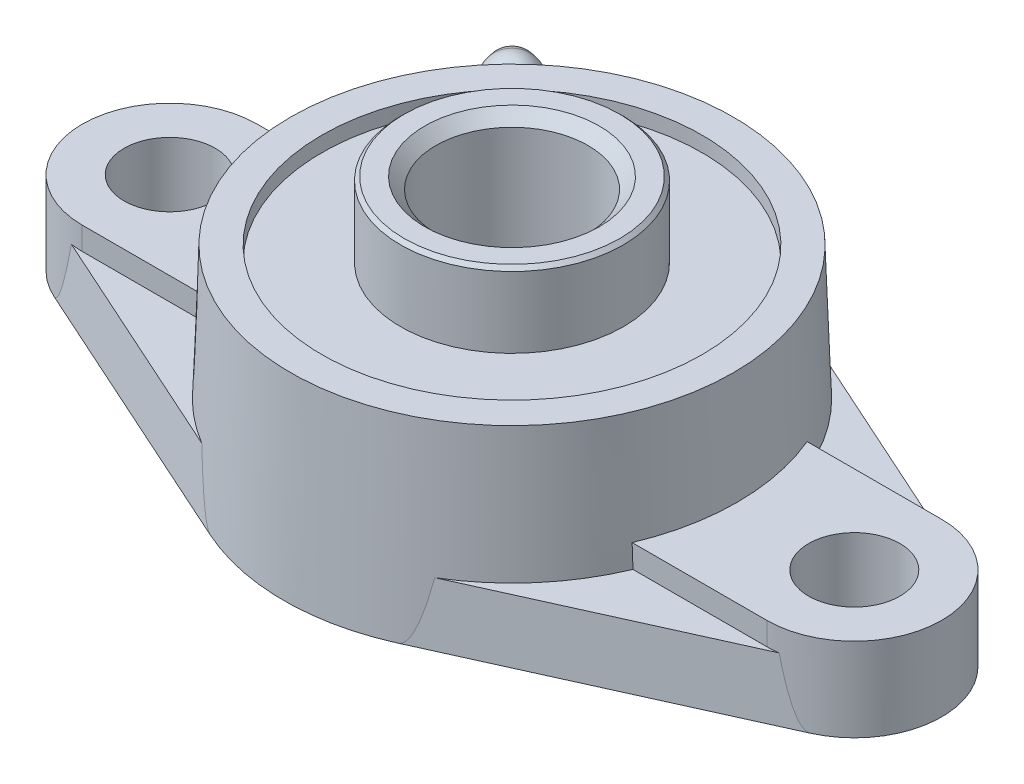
ISO-10303-21;
HEADER;
FILE_DESCRIPTION(('STEP AP214'),'2;1');
FILE_NAME('part.step','',(''),(''),'','','');
FILE_SCHEMA(('AUTOMOTIVE_DESIGN { 1 0 10303 214 1 1 1 1 }'));
ENDSEC;
DATA;
#1=APPLICATION_CONTEXT('core data for automotive mechanical design processes');
#2=APPLICATION_PROTOCOL_DEFINITION('international standard','automotive_design',2000,#1);
#3=PRODUCT_CONTEXT('',#1,'mechanical');
#4=PRODUCT('Part','Part','',(#3));
#5=PRODUCT_RELATED_PRODUCT_CATEGORY('part','',(#4));
#6=PRODUCT_DEFINITION_FORMATION('','',#4);
#7=PRODUCT_DEFINITION_CONTEXT('part definition',#1,'design');
#8=PRODUCT_DEFINITION('design','',#6,#7);
#9=PRODUCT_DEFINITION_SHAPE('','',#8);
#10=(LENGTH_UNIT() NAMED_UNIT(*) SI_UNIT(.MILLI.,.METRE.));
#11=(NAMED_UNIT(*) PLANE_ANGLE_UNIT() SI_UNIT($,.RADIAN.));
#12=(NAMED_UNIT(*) SI_UNIT($,.STERADIAN.) SOLID_ANGLE_UNIT());
#13=UNCERTAINTY_MEASURE_WITH_UNIT(LENGTH_MEASURE(1.E-05),#10,'distance_accuracy_value','');
#14=(GEOMETRIC_REPRESENTATION_CONTEXT(3) GLOBAL_UNCERTAINTY_ASSIGNED_CONTEXT((#13)) GLOBAL_UNIT_ASSIGNED_CONTEXT((#10,
#11,#12)) REPRESENTATION_CONTEXT('',''));
#15=CARTESIAN_POINT('',(0.,0.,0.));
#16=DIRECTION('',(0.,0.,1.));
#17=DIRECTION('',(1.,0.,0.));
#18=AXIS2_PLACEMENT_3D('',#15,#16,#17);
#19=CARTESIAN_POINT('',(12.3333333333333,0.,-27.3475572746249));
#20=DIRECTION('',(0.410355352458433,0.0606076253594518,-0.909909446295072));
#21=DIRECTION('',(-0.911585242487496,0.,-0.411111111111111));
#22=AXIS2_PLACEMENT_3D('',#19,#20,#21);
#23=PLANE('',#22);
#24=CARTESIAN_POINT('',(45.,189.396286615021,0.));
#25=DIRECTION('',(-0.410355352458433,-0.0606076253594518,0.909909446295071));
#26=DIRECTION('',(0.0249164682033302,-0.998161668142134,-0.0552490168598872));
#27=AXIS2_PLACEMENT_3D('',#24,#25,#26);
#28=ELLIPSE('',#27,189.745101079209,11.5);
#29=CARTESIAN_POINT('',(46.5134478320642,8.,-11.3999770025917));
#30=VERTEX_POINT('',#29);
#31=CARTESIAN_POINT('',(49.7277777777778,0.,-10.4832302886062));
#32=VERTEX_POINT('',#31);
#33=EDGE_CURVE('E604',#30,#32,#28,.T.);
#34=ORIENTED_EDGE('',*,*,#33,.T.);
#35=DIRECTION('',(-0.911585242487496,0.,-0.411111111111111));
#36=VECTOR('',#35,1.);
#37=CARTESIAN_POINT('',(49.7277777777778,0.,-10.4832302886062));
#38=LINE('',#37,#36);
#39=CARTESIAN_POINT('',(12.3333333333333,0.,-27.3475572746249));
#40=VERTEX_POINT('',#39);
#41=EDGE_CURVE('E350',#32,#40,#38,.T.);
#42=ORIENTED_EDGE('',*,*,#41,.T.);
#43=CARTESIAN_POINT('',(4.5033006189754,313.673609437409,-9.98548148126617));
#44=DIRECTION('',(-0.410355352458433,-0.0606076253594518,0.909909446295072));
#45=DIRECTION('',(0.0249164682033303,-0.998161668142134,-0.0552490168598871));
#46=AXIS2_PLACEMENT_3D('',#43,#44,#45);
#47=ELLIPSE('',#46,314.251307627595,15.580806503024);
#48=CARTESIAN_POINT('',(15.3209226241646,8.,-25.4673325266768));
#49=VERTEX_POINT('',#48);
#50=EDGE_CURVE('E531',#40,#49,#47,.T.);
#51=ORIENTED_EDGE('',*,*,#50,.T.);
#52=DIRECTION('',(0.911585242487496,0.,0.411111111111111));
#53=VECTOR('',#52,1.);
#54=CARTESIAN_POINT('',(49.5280789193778,8.,-10.0404241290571));
#55=LINE('',#54,#53);
#56=EDGE_CURVE('E646',#49,#30,#55,.T.);
#57=ORIENTED_EDGE('',*,*,#56,.T.);
#58=EDGE_LOOP('',(#34,#42,#51,#57));
#59=FACE_BOUND('',#58,.T.);
#60=ADVANCED_FACE('F15',(#59),#23,.T.);
#61=CARTESIAN_POINT('',(-49.7277777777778,0.,-10.4832302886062));
#62=DIRECTION('',(-0.410355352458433,0.0606076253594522,-0.909909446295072));
#63=DIRECTION('',(-0.911585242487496,0.,0.411111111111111));
#64=AXIS2_PLACEMENT_3D('',#61,#62,#63);
#65=PLANE('',#64);
#66=CARTESIAN_POINT('',(-45.,189.39628661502,0.));
#67=DIRECTION('',(0.410355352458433,-0.0606076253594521,0.909909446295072));
#68=DIRECTION('',(0.0249164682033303,0.998161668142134,0.0552490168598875));
#69=AXIS2_PLACEMENT_3D('',#66,#67,#68);
#70=ELLIPSE('',#69,189.745101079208,11.5);
#71=CARTESIAN_POINT('',(-49.7277777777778,0.,-10.4832302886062));
#72=VERTEX_POINT('',#71);
#73=CARTESIAN_POINT('',(-46.5134478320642,8.,-11.3999770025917));
#74=VERTEX_POINT('',#73);
#75=EDGE_CURVE('E619',#72,#74,#70,.T.);
#76=ORIENTED_EDGE('',*,*,#75,.T.);
#77=DIRECTION('',(0.911585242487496,0.,-0.411111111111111));
#78=VECTOR('',#77,1.);
#79=CARTESIAN_POINT('',(-12.1336344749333,8.,-26.9047511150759));
#80=LINE('',#79,#78);
#81=CARTESIAN_POINT('',(-15.3209226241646,8.,-25.4673325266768));
#82=VERTEX_POINT('',#81);
#83=EDGE_CURVE('E352',#74,#82,#80,.T.);
#84=ORIENTED_EDGE('',*,*,#83,.T.);
#85=CARTESIAN_POINT('',(-4.50330061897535,313.673609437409,-9.98548148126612));
#86=DIRECTION('',(0.410355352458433,-0.0606076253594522,0.909909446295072));
#87=DIRECTION('',(-0.0249164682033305,-0.998161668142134,-0.0552490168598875));
#88=AXIS2_PLACEMENT_3D('',#85,#86,#87);
#89=ELLIPSE('',#88,314.251307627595,15.580806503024);
#90=CARTESIAN_POINT('',(-12.3333333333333,0.,-27.3475572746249));
#91=VERTEX_POINT('',#90);
#92=EDGE_CURVE('E26',#82,#91,#89,.T.);
#93=ORIENTED_EDGE('',*,*,#92,.T.);
#94=DIRECTION('',(-0.911585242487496,0.,0.411111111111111));
#95=VECTOR('',#94,1.);
#96=CARTESIAN_POINT('',(-12.3333333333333,0.,-27.3475572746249));
#97=LINE('',#96,#95);
#98=EDGE_CURVE('E590',#91,#72,#97,.T.);
#99=ORIENTED_EDGE('',*,*,#98,.T.);
#100=EDGE_LOOP('',(#76,#84,#93,#99));
#101=FACE_BOUND('',#100,.T.);
#102=ADVANCED_FACE('F905',(#101),#65,.T.);
#103=CARTESIAN_POINT('',(-14.55475,25.5,0.));
#104=DIRECTION('',(0.,1.,0.));
#105=DIRECTION('',(-1.,0.,0.));
#106=AXIS2_PLACEMENT_3D('',#103,#104,#105);
#107=PLANE('',#106);
#108=CARTESIAN_POINT('',(0.,25.5,0.));
#109=DIRECTION('',(0.,1.,0.));
#110=DIRECTION('',(-1.,0.,0.));
#111=AXIS2_PLACEMENT_3D('',#108,#109,#110);
#112=CIRCLE('',#111,29.1095);
#113=CARTESIAN_POINT('',(-29.1095,25.5,0.));
#114=VERTEX_POINT('',#113);
#115=EDGE_CURVE('E9',#114,#114,#112,.T.);
#116=ORIENTED_EDGE('',*,*,#115,.T.);
#117=EDGE_LOOP('',(#116));
#118=FACE_BOUND('',#117,.T.);
#119=CARTESIAN_POINT('',(0.,25.5,0.));
#120=DIRECTION('',(0.,-1.,0.));
#121=DIRECTION('',(1.,0.,0.));
#122=AXIS2_PLACEMENT_3D('',#119,#120,#121);
#123=CIRCLE('',#122,25.);
#124=CARTESIAN_POINT('',(-25.,25.5,0.));
#125=VERTEX_POINT('',#124);
#126=EDGE_CURVE('E615',#125,#125,#123,.T.);
#127=ORIENTED_EDGE('',*,*,#126,.T.);
#128=EDGE_LOOP('',(#127));
#129=FACE_BOUND('',#128,.T.);
#130=ADVANCED_FACE('F807',(#118,#129),#107,.T.);
#131=CARTESIAN_POINT('',(0.,12.75,0.));
#132=DIRECTION('',(0.,-1.,0.));
#133=DIRECTION('',(-1.,0.,0.));
#134=AXIS2_PLACEMENT_3D('',#131,#132,#133);
#135=CONICAL_SURFACE('',#134,29.55475,0.03490738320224);
#136=ORIENTED_EDGE('',*,*,#115,.F.);
#137=EDGE_LOOP('',(#136));
#138=FACE_BOUND('',#137,.T.);
#139=CARTESIAN_POINT('',(-27.2919278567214,11.,11.5));
#140=CARTESIAN_POINT('',(-27.4987734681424,5.54163726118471,11.5));
#141=CARTESIAN_POINT('',(-27.7083020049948,0.,11.5));
#142=(BOUNDED_CURVE() B_SPLINE_CURVE(2,(#139,#140,#141),.UNSPECIFIED.,.F.,
.F.) B_SPLINE_CURVE_WITH_KNOTS((3,3),(0.,11.0078775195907),
.UNSPECIFIED.) CURVE() GEOMETRIC_REPRESENTATION_ITEM() RATIONAL_B_SPLINE_CURVE((1.,
1.00002439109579,1.)) REPRESENTATION_ITEM(''));
#143=CARTESIAN_POINT('',(-27.2919278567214,11.,11.5));
#144=VERTEX_POINT('',#143);
#145=CARTESIAN_POINT('',(-27.4055778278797,8.,11.5));
#146=VERTEX_POINT('',#145);
#147=EDGE_CURVE('E439',#144,#146,#142,.T.);
#148=ORIENTED_EDGE('',*,*,#147,.T.);
#149=CARTESIAN_POINT('',(0.,8.,0.));
#150=DIRECTION('',(0.,-1.,0.));
#151=DIRECTION('',(-1.,0.,0.));
#152=AXIS2_PLACEMENT_3D('',#149,#150,#151);
#153=CIRCLE('',#152,29.7206274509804);
#154=CARTESIAN_POINT('',(-15.3209226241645,8.,25.4673325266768));
#155=VERTEX_POINT('',#154);
#156=EDGE_CURVE('E390',#155,#146,#153,.T.);
#157=ORIENTED_EDGE('',*,*,#156,.F.);
#158=CARTESIAN_POINT('',(-4.50330061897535,313.673609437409,9.98548148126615));
#159=DIRECTION('',(0.410355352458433,-0.060607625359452,-0.909909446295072));
#160=DIRECTION('',(0.024916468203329,0.998161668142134,-0.055249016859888));
#161=AXIS2_PLACEMENT_3D('',#158,#159,#160);
#162=ELLIPSE('',#161,314.251307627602,15.580806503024);
#163=CARTESIAN_POINT('',(-12.3333333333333,0.,27.3475572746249));
#164=VERTEX_POINT('',#163);
#165=EDGE_CURVE('E446',#164,#155,#162,.T.);
#166=ORIENTED_EDGE('',*,*,#165,.F.);
#167=CARTESIAN_POINT('',(0.,0.,0.));
#168=DIRECTION('',(0.,1.,0.));
#169=DIRECTION('',(1.,0.,0.));
#170=AXIS2_PLACEMENT_3D('',#167,#168,#169);
#171=CIRCLE('',#170,30.);
#172=CARTESIAN_POINT('',(12.3333333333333,0.,27.3475572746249));
#173=VERTEX_POINT('',#172);
#174=EDGE_CURVE('E429',#164,#173,#171,.T.);
#175=ORIENTED_EDGE('',*,*,#174,.T.);
#176=CARTESIAN_POINT('',(4.50330061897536,313.673609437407,9.98548148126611));
#177=DIRECTION('',(-0.410355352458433,-0.0606076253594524,-0.909909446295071));
#178=DIRECTION('',(0.0249164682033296,-0.998161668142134,0.0552490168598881));
#179=AXIS2_PLACEMENT_3D('',#176,#177,#178);
#180=ELLIPSE('',#179,314.251307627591,15.5808065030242);
#181=CARTESIAN_POINT('',(15.3209226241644,8.,25.4673325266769));
#182=VERTEX_POINT('',#181);
#183=EDGE_CURVE('E443',#182,#173,#180,.T.);
#184=ORIENTED_EDGE('',*,*,#183,.F.);
#185=CARTESIAN_POINT('',(0.,8.,0.));
#186=DIRECTION('',(0.,-1.,0.));
#187=DIRECTION('',(-1.,0.,0.));
#188=AXIS2_PLACEMENT_3D('',#185,#186,#187);
#189=CIRCLE('',#188,29.7206274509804);
#190=CARTESIAN_POINT('',(27.4055778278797,8.,11.5));
#191=VERTEX_POINT('',#190);
#192=EDGE_CURVE('E561',#191,#182,#189,.T.);
#193=ORIENTED_EDGE('',*,*,#192,.F.);
#194=CARTESIAN_POINT('',(27.7083020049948,0.,11.5));
#195=CARTESIAN_POINT('',(27.4987734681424,5.5416372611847,11.5));
#196=CARTESIAN_POINT('',(27.2919278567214,11.,11.5));
#197=(BOUNDED_CURVE() B_SPLINE_CURVE(2,(#194,#195,#196),.UNSPECIFIED.,.F.,
.F.) B_SPLINE_CURVE_WITH_KNOTS((3,3),(0.,11.0078775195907),
.UNSPECIFIED.) CURVE() GEOMETRIC_REPRESENTATION_ITEM() RATIONAL_B_SPLINE_CURVE((1.,
1.0000243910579,1.)) REPRESENTATION_ITEM(''));
#198=CARTESIAN_POINT('',(27.2919278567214,11.,11.5));
#199=VERTEX_POINT('',#198);
#200=EDGE_CURVE('E505',#191,#199,#197,.T.);
#201=ORIENTED_EDGE('',*,*,#200,.T.);
#202=CARTESIAN_POINT('',(0.,11.,0.));
#203=DIRECTION('',(0.,1.,0.));
#204=DIRECTION('',(-1.,0.,0.));
#205=AXIS2_PLACEMENT_3D('',#202,#203,#204);
#206=CIRCLE('',#205,29.615862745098);
#207=CARTESIAN_POINT('',(27.2919278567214,11.,-11.5));
#208=VERTEX_POINT('',#207);
#209=EDGE_CURVE('E447',#199,#208,#206,.T.);
#210=ORIENTED_EDGE('',*,*,#209,.T.);
#211=CARTESIAN_POINT('',(27.2919278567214,11.,-11.5));
#212=CARTESIAN_POINT('',(27.4987734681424,5.5416372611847,-11.5));
#213=CARTESIAN_POINT('',(27.7083020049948,0.,-11.5));
#214=(BOUNDED_CURVE() B_SPLINE_CURVE(2,(#211,#212,#213),.UNSPECIFIED.,.F.,
.F.) B_SPLINE_CURVE_WITH_KNOTS((3,3),(0.,11.0078775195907),
.UNSPECIFIED.) CURVE() GEOMETRIC_REPRESENTATION_ITEM() RATIONAL_B_SPLINE_CURVE((1.,
1.0000243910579,1.)) REPRESENTATION_ITEM(''));
#215=CARTESIAN_POINT('',(27.4055778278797,8.,-11.5));
#216=VERTEX_POINT('',#215);
#217=EDGE_CURVE('E402',#208,#216,#214,.T.);
#218=ORIENTED_EDGE('',*,*,#217,.T.);
#219=CARTESIAN_POINT('',(0.,8.,0.));
#220=DIRECTION('',(0.,-1.,0.));
#221=DIRECTION('',(-1.,0.,0.));
#222=AXIS2_PLACEMENT_3D('',#219,#220,#221);
#223=CIRCLE('',#222,29.7206274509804);
#224=EDGE_CURVE('E649',#49,#216,#223,.T.);
#225=ORIENTED_EDGE('',*,*,#224,.F.);
#226=ORIENTED_EDGE('',*,*,#50,.F.);
#227=CARTESIAN_POINT('',(0.,0.,0.));
#228=DIRECTION('',(0.,1.,0.));
#229=DIRECTION('',(1.,0.,0.));
#230=AXIS2_PLACEMENT_3D('',#227,#228,#229);
#231=CIRCLE('',#230,30.);
#232=EDGE_CURVE('E594',#40,#91,#231,.T.);
#233=ORIENTED_EDGE('',*,*,#232,.T.);
#234=ORIENTED_EDGE('',*,*,#92,.F.);
#235=CARTESIAN_POINT('',(0.,8.,0.));
#236=DIRECTION('',(0.,-1.,0.));
#237=DIRECTION('',(-1.,0.,0.));
#238=AXIS2_PLACEMENT_3D('',#235,#236,#237);
#239=CIRCLE('',#238,29.7206274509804);
#240=CARTESIAN_POINT('',(-27.4055778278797,8.,-11.5));
#241=VERTEX_POINT('',#240);
#242=EDGE_CURVE('E357',#241,#82,#239,.T.);
#243=ORIENTED_EDGE('',*,*,#242,.F.);
#244=CARTESIAN_POINT('',(-27.7083020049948,0.,-11.5));
#245=CARTESIAN_POINT('',(-27.4987734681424,5.54163726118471,-11.5));
#246=CARTESIAN_POINT('',(-27.2919278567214,11.,-11.5));
#247=(BOUNDED_CURVE() B_SPLINE_CURVE(2,(#244,#245,#246),.UNSPECIFIED.,.F.,
.F.) B_SPLINE_CURVE_WITH_KNOTS((3,3),(0.,11.0078775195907),
.UNSPECIFIED.) CURVE() GEOMETRIC_REPRESENTATION_ITEM() RATIONAL_B_SPLINE_CURVE((1.,
1.00002439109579,1.)) REPRESENTATION_ITEM(''));
#248=CARTESIAN_POINT('',(-27.2919278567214,11.,-11.5));
#249=VERTEX_POINT('',#248);
#250=EDGE_CURVE('E468',#241,#249,#247,.T.);
#251=ORIENTED_EDGE('',*,*,#250,.T.);
#252=CARTESIAN_POINT('',(0.,11.,0.));
#253=DIRECTION('',(0.,1.,0.));
#254=DIRECTION('',(-1.,0.,0.));
#255=AXIS2_PLACEMENT_3D('',#252,#253,#254);
#256=CIRCLE('',#255,29.615862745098);
#257=EDGE_CURVE('E587',#249,#144,#256,.T.);
#258=ORIENTED_EDGE('',*,*,#257,.T.);
#259=EDGE_LOOP('',(#148,#157,#166,#175,#184,#193,#201,#210,#218,#225,#226,#233,#234,#243,#251,#258));
#260=FACE_BOUND('',#259,.T.);
#261=CARTESIAN_POINT('',(-21.1783950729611,23.1225592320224,-20.0917654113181));
#262=CARTESIAN_POINT('',(-21.2757563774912,19.1118085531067,-20.1926424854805));
#263=CARTESIAN_POINT('',(-21.3724070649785,15.1274407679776,-20.2929261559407));
#264=(BOUNDED_CURVE() B_SPLINE_CURVE(2,(#261,#262,#263),.UNSPECIFIED.,.F.,
.F.) B_SPLINE_CURVE_WITH_KNOTS((3,3),(0.,8.00000159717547),
.UNSPECIFIED.) CURVE() GEOMETRIC_REPRESENTATION_ITEM() RATIONAL_B_SPLINE_CURVE((1.,1.,1.)) REPRESENTATION_ITEM(''));
#265=CARTESIAN_POINT('',(-21.3457650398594,16.2256873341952,-20.2652854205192));
#266=VERTEX_POINT('',#265);
#267=CARTESIAN_POINT('',(-21.3706248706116,15.2009104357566,-20.291076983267));
#268=VERTEX_POINT('',#267);
#269=EDGE_CURVE('E726',#266,#268,#264,.T.);
#270=ORIENTED_EDGE('',*,*,#269,.T.);
#271=CARTESIAN_POINT('',(-21.3706248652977,15.2009104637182,-20.2910769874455));
#272=CARTESIAN_POINT('',(-21.3585466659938,15.1966820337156,-20.3040122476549));
#273=CARTESIAN_POINT('',(-21.3464289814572,15.1925999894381,-20.316958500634));
#274=CARTESIAN_POINT('',(-21.3221236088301,15.1847319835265,-20.3428629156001));
#275=CARTESIAN_POINT('',(-21.3099359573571,15.1809458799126,-20.3558210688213));
#276=CARTESIAN_POINT('',(-21.2854905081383,15.1736697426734,-20.3817489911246));
#277=CARTESIAN_POINT('',(-21.2732327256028,15.1701796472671,-20.3947187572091));
#278=CARTESIAN_POINT('',(-21.2486468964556,15.1634954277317,-20.4206696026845));
#279=CARTESIAN_POINT('',(-21.2363188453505,15.1603013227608,-20.433650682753));
#280=CARTESIAN_POINT('',(-21.2115923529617,15.1542090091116,-20.4596238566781));
#281=CARTESIAN_POINT('',(-21.199193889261,15.1513109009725,-20.4726159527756));
#282=CARTESIAN_POINT('',(-21.1743264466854,15.1458104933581,-20.4986108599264));
#283=CARTESIAN_POINT('',(-21.1618574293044,15.1432083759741,-20.5116136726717));
#284=CARTESIAN_POINT('',(-21.136848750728,15.1382998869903,-20.5376297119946));
#285=CARTESIAN_POINT('',(-21.1243090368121,15.1359937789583,-20.5506429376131));
#286=CARTESIAN_POINT('',(-21.0991588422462,15.1316771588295,-20.5766795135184));
#287=CARTESIAN_POINT('',(-21.0865482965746,15.1296669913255,-20.5897028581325));
#288=CARTESIAN_POINT('',(-21.0739112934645,15.1278060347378,-20.6027218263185));
#289=B_SPLINE_CURVE_WITH_KNOTS('',3,(#271,#272,#273,#274,#275,#276,#277,#278,#279,#280,#281,
#282,#283,#284,#285,#286,#287,#288),.UNSPECIFIED.,.F.,.F.,(4,2,2,2,2,2,2,2,4),(0.,
0.054586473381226,0.1091465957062,0.163695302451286,0.21824753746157,0.272818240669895,
0.327422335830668,0.382074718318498,0.436790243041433),.UNSPECIFIED.);
#290=CARTESIAN_POINT('',(-21.0739196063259,15.1277201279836,-20.602717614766));
#291=VERTEX_POINT('',#290);
#292=EDGE_CURVE('E330',#268,#291,#289,.T.);
#293=ORIENTED_EDGE('',*,*,#292,.T.);
#294=CARTESIAN_POINT('',(0.0254660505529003,14.0964910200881,0.0254660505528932));
#295=DIRECTION('',(-0.0246982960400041,-0.999389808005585,-0.0246982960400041));
#296=DIRECTION('',(0.706675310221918,-0.0349286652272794,0.706675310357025));
#297=AXIS2_PLACEMENT_3D('',#294,#295,#296);
#298=ELLIPSE('',#297,29.5257447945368,29.5077064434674);
#299=CARTESIAN_POINT('',(-20.602717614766,15.1277201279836,-21.073919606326));
#300=VERTEX_POINT('',#299);
#301=EDGE_CURVE('E935',#291,#300,#298,.T.);
#302=ORIENTED_EDGE('',*,*,#301,.T.);
#303=CARTESIAN_POINT('',(-20.6027218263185,15.1278060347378,-21.0739112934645));
#304=CARTESIAN_POINT('',(-20.5897028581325,15.1296669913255,-21.0865482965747));
#305=CARTESIAN_POINT('',(-20.5766795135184,15.1316771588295,-21.0991588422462));
#306=CARTESIAN_POINT('',(-20.550642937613,15.1359937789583,-21.1243090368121));
#307=CARTESIAN_POINT('',(-20.5376297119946,15.1382998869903,-21.1368487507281));
#308=CARTESIAN_POINT('',(-20.5116136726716,15.1432083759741,-21.1618574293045));
#309=CARTESIAN_POINT('',(-20.4986108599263,15.1458104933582,-21.1743264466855));
#310=CARTESIAN_POINT('',(-20.4726159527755,15.1513109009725,-21.1991938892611));
#311=CARTESIAN_POINT('',(-20.459623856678,15.1542090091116,-21.2115923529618));
#312=CARTESIAN_POINT('',(-20.4336506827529,15.1603013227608,-21.2363188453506));
#313=CARTESIAN_POINT('',(-20.4206696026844,15.1634954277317,-21.2486468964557));
#314=CARTESIAN_POINT('',(-20.394718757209,15.1701796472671,-21.2732327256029));
#315=CARTESIAN_POINT('',(-20.3817489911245,15.1736697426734,-21.2854905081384));
#316=CARTESIAN_POINT('',(-20.3558210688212,15.1809458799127,-21.3099359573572));
#317=CARTESIAN_POINT('',(-20.3428629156,15.1847319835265,-21.3221236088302));
#318=CARTESIAN_POINT('',(-20.3169585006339,15.1925999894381,-21.3464289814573));
#319=CARTESIAN_POINT('',(-20.3040122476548,15.1966820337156,-21.3585466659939));
#320=CARTESIAN_POINT('',(-20.2910769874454,15.2009104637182,-21.3706248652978));
#321=B_SPLINE_CURVE_WITH_KNOTS('',3,(#303,#304,#305,#306,#307,#308,#309,#310,#311,#312,#313,
#314,#315,#316,#317,#318,#319,#320),.UNSPECIFIED.,.F.,.F.,(4,2,2,2,2,2,2,2,4),(0.,
0.054715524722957,0.109367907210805,0.163972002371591,0.218542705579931,0.273094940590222,
0.327643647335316,0.382203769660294,0.43679024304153),.UNSPECIFIED.);
#322=CARTESIAN_POINT('',(-20.2910769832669,15.2009104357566,-21.3706248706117));
#323=VERTEX_POINT('',#322);
#324=EDGE_CURVE('E2051',#300,#323,#321,.T.);
#325=ORIENTED_EDGE('',*,*,#324,.T.);
#326=CARTESIAN_POINT('',(-20.2929261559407,15.1274407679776,-21.3724070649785));
#327=CARTESIAN_POINT('',(-20.1926424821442,19.1118086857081,-21.2757563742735));
#328=CARTESIAN_POINT('',(-20.0917654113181,23.1225592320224,-21.1783950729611));
#329=(BOUNDED_CURVE() B_SPLINE_CURVE(2,(#326,#327,#328),.UNSPECIFIED.,.F.,
.F.) B_SPLINE_CURVE_WITH_KNOTS((3,3),(0.,8.00000159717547),
.UNSPECIFIED.) CURVE() GEOMETRIC_REPRESENTATION_ITEM() RATIONAL_B_SPLINE_CURVE((1.,1.,1.)) REPRESENTATION_ITEM(''));
#330=CARTESIAN_POINT('',(-20.2652854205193,16.2256873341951,-21.3457650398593));
#331=VERTEX_POINT('',#330);
#332=EDGE_CURVE('E363',#323,#331,#329,.T.);
#333=ORIENTED_EDGE('',*,*,#332,.T.);
#334=CARTESIAN_POINT('',(-20.2652914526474,16.2257235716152,-21.3457575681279));
#335=CARTESIAN_POINT('',(-20.2356623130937,16.236347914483,-21.3733756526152));
#336=CARTESIAN_POINT('',(-20.2061119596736,16.2477946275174,-21.4007634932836));
#337=CARTESIAN_POINT('',(-20.1473814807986,16.2722709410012,-21.4548903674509));
#338=CARTESIAN_POINT('',(-20.1182002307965,16.2852920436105,-21.4816320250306));
#339=CARTESIAN_POINT('',(-20.060214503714,16.3129167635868,-21.5344722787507));
#340=CARTESIAN_POINT('',(-20.0314090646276,16.327514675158,-21.5605728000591));
#341=CARTESIAN_POINT('',(-19.9741814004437,16.3582895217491,-21.6121369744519));
#342=CARTESIAN_POINT('',(-19.9457585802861,16.3744635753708,-21.6376016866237));
#343=CARTESIAN_POINT('',(-19.8893021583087,16.4083880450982,-21.6879004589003));
#344=CARTESIAN_POINT('',(-19.8612685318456,16.4261383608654,-21.7127345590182));
#345=CARTESIAN_POINT('',(-19.8055961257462,16.4632124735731,-21.7617784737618));
#346=CARTESIAN_POINT('',(-19.7779580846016,16.4825388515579,-21.7859871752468));
#347=CARTESIAN_POINT('',(-19.7230822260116,16.5227626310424,-21.8337866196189));
#348=CARTESIAN_POINT('',(-19.6958460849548,16.5436651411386,-21.8573749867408));
#349=CARTESIAN_POINT('',(-19.6417786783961,16.5870379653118,-21.9039405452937));
#350=CARTESIAN_POINT('',(-19.6149501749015,16.6095157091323,-21.9269140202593));
#351=CARTESIAN_POINT('',(-19.5627605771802,16.6551161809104,-21.9713552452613));
#352=CARTESIAN_POINT('',(-19.5373803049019,16.6781929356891,-21.9928476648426));
#353=CARTESIAN_POINT('',(-19.4873440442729,16.7255454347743,-22.0349881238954));
#354=CARTESIAN_POINT('',(-19.4626852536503,16.7498151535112,-22.0556396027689));
#355=CARTESIAN_POINT('',(-19.414098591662,16.7995505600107,-22.096107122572));
#356=CARTESIAN_POINT('',(-19.390168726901,16.8250123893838,-22.1159255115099));
#357=CARTESIAN_POINT('',(-19.3430462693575,16.8771300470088,-22.15473545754));
#358=CARTESIAN_POINT('',(-19.3198526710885,16.9037841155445,-22.1737281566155));
#359=CARTESIAN_POINT('',(-19.2742085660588,16.958284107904,-22.2108952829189));
#360=CARTESIAN_POINT('',(-19.251758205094,16.9861302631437,-22.2290695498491));
#361=CARTESIAN_POINT('',(-19.2076059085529,17.0430124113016,-22.2646082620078));
#362=CARTESIAN_POINT('',(-19.1859054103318,17.0720504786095,-22.2819711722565));
#363=CARTESIAN_POINT('',(-19.1432578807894,17.1313148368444,-22.3158953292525));
#364=CARTESIAN_POINT('',(-19.122313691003,17.1615448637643,-22.3324536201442));
#365=CARTESIAN_POINT('',(-19.0811828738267,17.2231907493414,-22.3647770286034));
#366=CARTESIAN_POINT('',(-19.0610005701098,17.2546117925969,-22.3805377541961));
#367=CARTESIAN_POINT('',(-19.0209203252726,17.3194156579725,-22.411644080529));
#368=CARTESIAN_POINT('',(-19.0010503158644,17.3528290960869,-22.4269619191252));
#369=CARTESIAN_POINT('',(-18.9624260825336,17.4204757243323,-22.456537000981));
#370=CARTESIAN_POINT('',(-18.9436663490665,17.4547034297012,-22.4707995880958));
#371=CARTESIAN_POINT('',(-18.9072676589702,17.5239759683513,-22.4982746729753));
#372=CARTESIAN_POINT('',(-18.8896247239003,17.5590172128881,-22.5114909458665));
#373=CARTESIAN_POINT('',(-18.855464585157,17.6299150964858,-22.5368829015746));
#374=CARTESIAN_POINT('',(-18.8389451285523,17.6657698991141,-22.5490606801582));
#375=CARTESIAN_POINT('',(-18.8070360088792,17.7382931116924,-22.5723849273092));
#376=CARTESIAN_POINT('',(-18.7916459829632,17.7749612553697,-22.5835317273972));
#377=CARTESIAN_POINT('',(-18.7619992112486,17.8491096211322,-22.6048027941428));
#378=CARTESIAN_POINT('',(-18.7477441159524,17.8865909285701,-22.6149255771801));
#379=CARTESIAN_POINT('',(-18.7203699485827,17.9623642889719,-22.6341570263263));
#380=CARTESIAN_POINT('',(-18.7072546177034,18.0006585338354,-22.6432623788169));
#381=CARTESIAN_POINT('',(-18.6821626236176,18.0780567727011,-22.6604664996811));
#382=CARTESIAN_POINT('',(-18.6701918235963,18.1171638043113,-22.6685601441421));
#383=CARTESIAN_POINT('',(-18.6476120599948,18.1954146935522,-22.6836008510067));
#384=CARTESIAN_POINT('',(-18.6369873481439,18.2345513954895,-22.6905615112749));
#385=CARTESIAN_POINT('',(-18.6170148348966,18.3130975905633,-22.7034041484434));
#386=CARTESIAN_POINT('',(-18.6076605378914,18.3525045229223,-22.7092916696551));
#387=CARTESIAN_POINT('',(-18.590230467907,18.4315899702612,-22.7199940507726));
#388=CARTESIAN_POINT('',(-18.5821501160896,18.4712669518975,-22.7248127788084));
#389=CARTESIAN_POINT('',(-18.5672683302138,18.5508914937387,-22.733383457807));
#390=CARTESIAN_POINT('',(-18.5604643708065,18.5908383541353,-22.7371375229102));
#391=CARTESIAN_POINT('',(-18.5481352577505,18.6710018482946,-22.7435840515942));
#392=CARTESIAN_POINT('',(-18.5426097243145,18.7112183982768,-22.7462768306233));
#393=CARTESIAN_POINT('',(-18.5328365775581,18.7919206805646,-22.7506054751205));
#394=CARTESIAN_POINT('',(-18.5285907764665,18.8324067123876,-22.7522398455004));
#395=CARTESIAN_POINT('',(-18.5213760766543,18.9136476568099,-22.7544553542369));
#396=CARTESIAN_POINT('',(-18.5184111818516,18.9544030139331,-22.7550332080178));
#397=CARTESIAN_POINT('',(-18.513755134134,19.0361823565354,-22.7551400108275));
#398=CARTESIAN_POINT('',(-18.5120701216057,19.0772066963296,-22.7546639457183));
#399=CARTESIAN_POINT('',(-18.5099845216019,19.1592006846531,-22.7526694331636));
#400=CARTESIAN_POINT('',(-18.5095819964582,19.2001703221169,-22.7511525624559));
#401=CARTESIAN_POINT('',(-18.5100807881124,19.2818578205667,-22.7470690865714));
#402=CARTESIAN_POINT('',(-18.510976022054,19.3225759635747,-22.7445074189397));
#403=CARTESIAN_POINT('',(-18.5140656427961,19.4037600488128,-22.7383366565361));
#404=CARTESIAN_POINT('',(-18.5162561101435,19.4442263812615,-22.7347307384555));
#405=CARTESIAN_POINT('',(-18.5219325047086,19.5249068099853,-22.7264718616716));
#406=CARTESIAN_POINT('',(-18.5254167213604,19.5651211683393,-22.7218202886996));
#407=CARTESIAN_POINT('',(-18.533675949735,19.6452978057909,-22.7114701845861));
#408=CARTESIAN_POINT('',(-18.5384514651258,19.6852599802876,-22.7057712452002));
#409=CARTESIAN_POINT('',(-18.5492881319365,19.764932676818,-22.6933258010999));
#410=CARTESIAN_POINT('',(-18.5553519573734,19.8046424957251,-22.6865771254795));
#411=CARTESIAN_POINT('',(-18.5687599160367,19.8838110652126,-22.6720306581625));
#412=CARTESIAN_POINT('',(-18.5761088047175,19.9232682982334,-22.6642289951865));
#413=CARTESIAN_POINT('',(-18.5920798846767,20.0019327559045,-22.6475752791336));
#414=CARTESIAN_POINT('',(-18.600708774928,20.0411374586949,-22.6387177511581));
#415=CARTESIAN_POINT('',(-18.6193165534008,20.1196319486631,-22.6198660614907));
#416=CARTESIAN_POINT('',(-18.6293144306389,20.1589134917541,-22.6098563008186));
#417=CARTESIAN_POINT('',(-18.6505042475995,20.2366607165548,-22.5888595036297));
#418=CARTESIAN_POINT('',(-18.6616898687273,20.275129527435,-22.5778776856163));
#419=CARTESIAN_POINT('',(-18.6852469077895,20.3512522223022,-22.5549339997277));
#420=CARTESIAN_POINT('',(-18.6976141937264,20.3889084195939,-22.5429755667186));
#421=CARTESIAN_POINT('',(-18.7235270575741,20.4634066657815,-22.5180743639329));
#422=CARTESIAN_POINT('',(-18.7370706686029,20.5002499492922,-22.5051332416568));
#423=CARTESIAN_POINT('',(-18.7653279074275,20.5731235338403,-22.4782620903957));
#424=CARTESIAN_POINT('',(-18.7800416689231,20.6091537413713,-22.4643319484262));
#425=CARTESIAN_POINT('',(-18.8106306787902,20.6804025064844,-22.4354774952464));
#426=CARTESIAN_POINT('',(-18.8265080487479,20.7156194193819,-22.4205513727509));
#427=CARTESIAN_POINT('',(-18.8594152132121,20.7852433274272,-22.3896992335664));
#428=CARTESIAN_POINT('',(-18.8764489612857,20.8196469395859,-22.3737698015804));
#429=CARTESIAN_POINT('',(-18.9116601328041,20.8876454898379,-22.3409041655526));
#430=CARTESIAN_POINT('',(-18.929843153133,20.9212351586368,-22.3239630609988));
#431=CARTESIAN_POINT('',(-18.9666547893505,20.9863941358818,-22.2897074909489));
#432=CARTESIAN_POINT('',(-18.985253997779,21.0179938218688,-22.2724191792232));
#433=CARTESIAN_POINT('',(-19.0232796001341,21.0799974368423,-22.2371000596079));
#434=CARTESIAN_POINT('',(-19.0427013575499,21.1104065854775,-22.219073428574));
#435=CARTESIAN_POINT('',(-19.082364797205,21.1700297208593,-22.1822720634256));
#436=CARTESIAN_POINT('',(-19.1026034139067,21.1992474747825,-22.1635001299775));
#437=CARTESIAN_POINT('',(-19.1438926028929,21.2564895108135,-22.1252026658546));
#438=CARTESIAN_POINT('',(-19.164941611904,21.284515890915,-22.1056785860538));
#439=CARTESIAN_POINT('',(-19.2078435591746,21.3393768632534,-22.0658709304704));
#440=CARTESIAN_POINT('',(-19.2296963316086,21.3662116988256,-22.0455875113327));
#441=CARTESIAN_POINT('',(-19.2741976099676,21.4186914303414,-22.0042549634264));
#442=CARTESIAN_POINT('',(-19.2968472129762,21.4443345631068,-21.9832047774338));
#443=CARTESIAN_POINT('',(-19.3429337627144,21.4944331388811,-21.940332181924));
#444=CARTESIAN_POINT('',(-19.3663729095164,21.5188847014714,-21.9185076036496));
#445=CARTESIAN_POINT('',(-19.4140303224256,21.5666014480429,-21.8740791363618));
#446=CARTESIAN_POINT('',(-19.4382517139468,21.5898605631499,-21.8514720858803));
#447=CARTESIAN_POINT('',(-19.4881735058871,21.6358510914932,-21.8048090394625));
#448=CARTESIAN_POINT('',(-19.5138959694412,21.6585352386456,-21.7807300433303));
#449=CARTESIAN_POINT('',(-19.5658254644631,21.7023081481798,-21.7320361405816));
#450=CARTESIAN_POINT('',(-19.5920291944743,21.7234047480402,-21.7074247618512));
#451=CARTESIAN_POINT('',(-19.644914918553,21.7640039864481,-21.657661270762));
#452=CARTESIAN_POINT('',(-19.6715948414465,21.7835121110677,-21.6325114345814));
#453=CARTESIAN_POINT('',(-19.7254261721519,21.8209370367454,-21.5816664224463));
#454=CARTESIAN_POINT('',(-19.7525766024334,21.8388567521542,-21.5559723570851));
#455=CARTESIAN_POINT('',(-19.8073423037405,21.8731073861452,-21.5040339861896));
#456=CARTESIAN_POINT('',(-19.8349575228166,21.8894384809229,-21.4777897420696));
#457=CARTESIAN_POINT('',(-19.8906461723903,21.9205148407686,-21.4247459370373));
#458=CARTESIAN_POINT('',(-19.9187202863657,21.9352574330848,-21.3979455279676));
#459=CARTESIAN_POINT('',(-19.9753201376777,21.9631589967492,-21.3437840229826));
#460=CARTESIAN_POINT('',(-20.0038470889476,21.9763123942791,-21.31642132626));
#461=CARTESIAN_POINT('',(-20.0613461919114,22.0010409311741,-21.2611298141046));
#462=CARTESIAN_POINT('',(-20.0903198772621,22.0126076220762,-21.2331988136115));
#463=CARTESIAN_POINT('',(-20.1194137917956,22.0233454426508,-21.2050772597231));
#464=B_SPLINE_CURVE_WITH_KNOTS('',3,(#334,#335,#336,#337,#338,#339,#340,#341,#342,#343,#344,
#345,#346,#347,#348,#349,#350,#351,#352,#353,#354,#355,#356,#357,#358,#359,#360,#361,#362,#363,
#364,#365,#366,#367,#368,#369,#370,#371,#372,#373,#374,#375,#376,#377,#378,#379,#380,#381,#382,
#383,#384,#385,#386,#387,#388,#389,#390,#391,#392,#393,#394,#395,#396,#397,#398,#399,#400,#401,
#402,#403,#404,#405,#406,#407,#408,#409,#410,#411,#412,#413,#414,#415,#416,#417,#418,#419,#420,
#421,#422,#423,#424,#425,#426,#427,#428,#429,#430,#431,#432,#433,#434,#435,#436,#437,#438,#439,
#440,#441,#442,#443,#444,#445,#446,#447,#448,#449,#450,#451,#452,#453,#454,#455,#456,#457,#458,
#459,#460,#461,#462,#463),.UNSPECIFIED.,.F.,.F.,(4,2,2,2,2,2,2,2,2,2,2,2,2,2,2,2,2,2,2,2,2,2,2,
2,2,2,2,2,2,2,2,2,2,2,2,2,2,2,2,2,2,2,2,2,2,2,2,2,2,2,2,2,2,2,2,2,2,2,2,2,2,2,2,2,4),(0.,
0.125617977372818,0.250585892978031,0.375115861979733,0.499422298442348,0.623720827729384,
0.748227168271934,0.873156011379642,0.998719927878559,1.12012783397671,1.24097537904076,
1.36145569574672,1.48176370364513,1.60209517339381,1.72264577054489,1.84361010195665,
1.96518078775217,2.09049804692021,2.21512971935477,2.33928901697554,2.46319150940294,
2.58705402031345,2.71109349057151,2.83552583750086,2.96056483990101,3.08397030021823,
3.20671890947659,3.3290157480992,3.45106800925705,3.5730839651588,3.69527190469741,
3.81783906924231,3.94099061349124,4.06395600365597,4.18634689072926,4.30836929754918,
4.43023094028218,4.55214018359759,4.67430497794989,4.79693180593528,4.92022466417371,
5.04544419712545,5.17002812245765,5.29419132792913,5.41815078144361,5.54212441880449,
5.66633000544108,5.79098400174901,5.91630046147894,6.03788400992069,6.15885537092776,
6.27940866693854,6.39974004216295,6.52004672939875,6.64052609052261,6.76137465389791,
6.88278717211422,7.00846622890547,7.13347741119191,7.25803671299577,7.38236253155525,
7.50667454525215,7.6311925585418,7.75613534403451,7.88171951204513),.UNSPECIFIED.);
#465=CARTESIAN_POINT('',(-20.1194137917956,22.0233454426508,-21.205077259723));
#466=VERTEX_POINT('',#465);
#467=EDGE_CURVE('E1995',#331,#466,#464,.T.);
#468=ORIENTED_EDGE('',*,*,#467,.T.);
#469=CARTESIAN_POINT('',(-20.2929261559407,15.1274407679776,-21.3724070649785));
#470=CARTESIAN_POINT('',(-20.1926424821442,19.1118086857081,-21.2757563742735));
#471=CARTESIAN_POINT('',(-20.0917654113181,23.1225592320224,-21.1783950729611));
#472=(BOUNDED_CURVE() B_SPLINE_CURVE(2,(#469,#470,#471),.UNSPECIFIED.,.F.,
.F.) B_SPLINE_CURVE_WITH_KNOTS((3,3),(0.,8.00000159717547),
.UNSPECIFIED.) CURVE() GEOMETRIC_REPRESENTATION_ITEM() RATIONAL_B_SPLINE_CURVE((1.,1.,1.)) REPRESENTATION_ITEM(''));
#473=CARTESIAN_POINT('',(-20.0936376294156,23.0481223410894,-21.180202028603));
#474=VERTEX_POINT('',#473);
#475=EDGE_CURVE('E1248',#466,#474,#472,.T.);
#476=ORIENTED_EDGE('',*,*,#475,.T.);
#477=CARTESIAN_POINT('',(-20.0936380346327,23.0481203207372,-21.1802017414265));
#478=CARTESIAN_POINT('',(-20.1064060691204,23.0524324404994,-21.1678811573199));
#479=CARTESIAN_POINT('',(-20.1191927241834,23.0565957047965,-21.1555277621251));
#480=CARTESIAN_POINT('',(-20.1447936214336,23.0646212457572,-21.1307642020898));
#481=CARTESIAN_POINT('',(-20.1576078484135,23.0684836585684,-21.1183540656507));
#482=CARTESIAN_POINT('',(-20.1832636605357,23.0759075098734,-21.0934767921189));
#483=CARTESIAN_POINT('',(-20.1961052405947,23.0794690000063,-21.0810096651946));
#484=CARTESIAN_POINT('',(-20.2218155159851,23.0862911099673,-21.0560182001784));
#485=CARTESIAN_POINT('',(-20.2346842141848,23.0895516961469,-21.0434938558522));
#486=CARTESIAN_POINT('',(-20.2604484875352,23.095772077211,-21.0183877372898));
#487=CARTESIAN_POINT('',(-20.2733440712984,23.0987317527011,-21.0058059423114));
#488=CARTESIAN_POINT('',(-20.2991618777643,23.104350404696,-20.9805847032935));
#489=CARTESIAN_POINT('',(-20.3120841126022,23.1070091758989,-20.9679452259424));
#490=CARTESIAN_POINT('',(-20.3379549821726,23.1120260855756,-20.942608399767));
#491=CARTESIAN_POINT('',(-20.3509036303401,23.1143839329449,-20.9299110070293));
#492=CARTESIAN_POINT('',(-20.3768270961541,23.1187991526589,-20.9044581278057));
#493=CARTESIAN_POINT('',(-20.3898019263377,23.1208561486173,-20.8917025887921));
#494=CARTESIAN_POINT('',(-20.4027798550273,23.122761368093,-20.8789275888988));
#495=B_SPLINE_CURVE_WITH_KNOTS('',3,(#477,#478,#479,#480,#481,#482,#483,#484,#485,#486,#487,
#488,#489,#490,#491,#492,#493,#494),.UNSPECIFIED.,.F.,.F.,(4,2,2,2,2,2,2,2,4),(0.,
0.0547782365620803,0.109531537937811,0.164275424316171,0.219025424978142,0.273797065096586,
0.328605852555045,0.383467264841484,0.438396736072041),.UNSPECIFIED.);
#496=CARTESIAN_POINT('',(-20.4027715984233,23.1228444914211,-20.8789315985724));
#497=VERTEX_POINT('',#496);
#498=EDGE_CURVE('E1245',#474,#497,#495,.T.);
#499=ORIENTED_EDGE('',*,*,#498,.T.);
#500=CARTESIAN_POINT('',(0.0252247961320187,22.1013874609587,0.0252247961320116));
#501=DIRECTION('',(0.0246982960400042,0.999389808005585,0.0246982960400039));
#502=DIRECTION('',(0.706675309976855,-0.0349286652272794,0.706675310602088));
#503=AXIS2_PLACEMENT_3D('',#500,#501,#502);
#504=ELLIPSE('',#503,29.2460305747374,29.2281631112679);
#505=CARTESIAN_POINT('',(-20.8789315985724,23.1228444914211,-20.4027715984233));
#506=VERTEX_POINT('',#505);
#507=EDGE_CURVE('E479',#497,#506,#504,.T.);
#508=ORIENTED_EDGE('',*,*,#507,.T.);
#509=CARTESIAN_POINT('',(-20.8789275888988,23.122761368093,-20.4027798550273));
#510=CARTESIAN_POINT('',(-20.8917025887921,23.1208561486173,-20.3898019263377));
#511=CARTESIAN_POINT('',(-20.9044581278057,23.1187991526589,-20.3768270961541));
#512=CARTESIAN_POINT('',(-20.9299110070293,23.1143839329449,-20.3509036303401));
#513=CARTESIAN_POINT('',(-20.942608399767,23.1120260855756,-20.3379549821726));
#514=CARTESIAN_POINT('',(-20.9679452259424,23.1070091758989,-20.3120841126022));
#515=CARTESIAN_POINT('',(-20.9805847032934,23.1043504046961,-20.2991618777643));
#516=CARTESIAN_POINT('',(-21.0058059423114,23.0987317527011,-20.2733440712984));
#517=CARTESIAN_POINT('',(-21.0183877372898,23.095772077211,-20.2604484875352));
#518=CARTESIAN_POINT('',(-21.0434938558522,23.0895516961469,-20.2346842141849));
#519=CARTESIAN_POINT('',(-21.0560182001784,23.0862911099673,-20.2218155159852));
#520=CARTESIAN_POINT('',(-21.0810096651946,23.0794690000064,-20.1961052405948));
#521=CARTESIAN_POINT('',(-21.0934767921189,23.0759075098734,-20.1832636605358));
#522=CARTESIAN_POINT('',(-21.1183540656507,23.0684836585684,-20.1576078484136));
#523=CARTESIAN_POINT('',(-21.1307642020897,23.0646212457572,-20.1447936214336));
#524=CARTESIAN_POINT('',(-21.1555277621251,23.0565957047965,-20.1191927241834));
#525=CARTESIAN_POINT('',(-21.1678811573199,23.0524324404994,-20.1064060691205));
#526=CARTESIAN_POINT('',(-21.1802017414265,23.0481203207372,-20.0936380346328));
#527=B_SPLINE_CURVE_WITH_KNOTS('',3,(#509,#510,#511,#512,#513,#514,#515,#516,#517,#518,#519,
#520,#521,#522,#523,#524,#525,#526),.UNSPECIFIED.,.F.,.F.,(4,2,2,2,2,2,2,2,4),(0.,
0.0549294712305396,0.109790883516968,0.164599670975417,0.219371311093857,0.274121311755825,
0.328865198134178,0.38361849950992,0.438396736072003),.UNSPECIFIED.);
#528=CARTESIAN_POINT('',(-21.180202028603,23.0481223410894,-20.0936376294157));
#529=VERTEX_POINT('',#528);
#530=EDGE_CURVE('E767',#506,#529,#527,.T.);
#531=ORIENTED_EDGE('',*,*,#530,.T.);
#532=CARTESIAN_POINT('',(-21.1783950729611,23.1225592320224,-20.0917654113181));
#533=CARTESIAN_POINT('',(-21.2757563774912,19.1118085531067,-20.1926424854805));
#534=CARTESIAN_POINT('',(-21.3724070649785,15.1274407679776,-20.2929261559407));
#535=(BOUNDED_CURVE() B_SPLINE_CURVE(2,(#532,#533,#534),.UNSPECIFIED.,.F.,
.F.) B_SPLINE_CURVE_WITH_KNOTS((3,3),(0.,8.00000159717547),
.UNSPECIFIED.) CURVE() GEOMETRIC_REPRESENTATION_ITEM() RATIONAL_B_SPLINE_CURVE((1.,1.,1.)) REPRESENTATION_ITEM(''));
#536=CARTESIAN_POINT('',(-21.2050772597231,22.0233454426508,-20.1194137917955));
#537=VERTEX_POINT('',#536);
#538=EDGE_CURVE('E1231',#529,#537,#535,.T.);
#539=ORIENTED_EDGE('',*,*,#538,.T.);
#540=CARTESIAN_POINT('',(-21.2050713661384,22.0233080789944,-20.1194218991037));
#541=CARTESIAN_POINT('',(-21.2332087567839,22.0125557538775,-20.0903120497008));
#542=CARTESIAN_POINT('',(-21.2611556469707,22.0009759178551,-20.0613221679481));
#543=CARTESIAN_POINT('',(-21.3164742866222,21.976225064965,-20.0037951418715));
#544=CARTESIAN_POINT('',(-21.3438482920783,21.9630627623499,-19.9752564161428));
#545=CARTESIAN_POINT('',(-21.3980278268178,21.9351473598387,-19.9186375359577));
#546=CARTESIAN_POINT('',(-21.4248350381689,21.9204001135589,-19.8905561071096));
#547=CARTESIAN_POINT('',(-21.477887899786,21.8893184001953,-19.834857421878));
#548=CARTESIAN_POINT('',(-21.504134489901,21.8729868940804,-19.8072394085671));
#549=CARTESIAN_POINT('',(-21.5560730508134,21.8387393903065,-19.7524727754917));
#550=CARTESIAN_POINT('',(-21.5817650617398,21.8208235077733,-19.7253241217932));
#551=CARTESIAN_POINT('',(-21.632601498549,21.7834101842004,-19.6715010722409));
#552=CARTESIAN_POINT('',(-21.6577449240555,21.7639101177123,-19.6448275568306));
#553=CARTESIAN_POINT('',(-21.7074911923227,21.7233309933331,-19.5919594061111));
#554=CARTESIAN_POINT('',(-21.7320918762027,21.7022467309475,-19.5657667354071));
#555=CARTESIAN_POINT('',(-21.7807599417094,21.6585022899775,-19.5138642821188));
#556=CARTESIAN_POINT('',(-21.8048239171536,21.6358345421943,-19.4881576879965));
#557=CARTESIAN_POINT('',(-21.8514685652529,21.589865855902,-19.4382553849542));
#558=CARTESIAN_POINT('',(-21.8740719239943,21.5666115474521,-19.4140379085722));
#559=CARTESIAN_POINT('',(-21.9184941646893,21.5189032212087,-19.3663871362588));
#560=CARTESIAN_POINT('',(-21.9403161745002,21.4944552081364,-19.3429507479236));
#561=CARTESIAN_POINT('',(-21.9831846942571,21.4443623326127,-19.2968686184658));
#562=CARTESIAN_POINT('',(-22.0042333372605,21.4187212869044,-19.2742207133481));
#563=CARTESIAN_POINT('',(-22.0455638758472,21.3662443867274,-19.2297216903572));
#564=CARTESIAN_POINT('',(-22.065846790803,21.3394102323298,-19.2078695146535));
#565=CARTESIAN_POINT('',(-22.1056544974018,21.2845492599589,-19.1649676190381));
#566=CARTESIAN_POINT('',(-22.1251790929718,21.2565221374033,-19.1439181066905));
#567=CARTESIAN_POINT('',(-22.1634786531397,21.1992772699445,-19.1026267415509));
#568=CARTESIAN_POINT('',(-22.1822521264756,21.1700573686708,-19.0823864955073));
#569=CARTESIAN_POINT('',(-22.219057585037,21.1104285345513,-19.0427186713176));
#570=CARTESIAN_POINT('',(-22.237086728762,21.0800157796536,-19.0232942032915));
#571=CARTESIAN_POINT('',(-22.2724120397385,21.0180037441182,-18.9852618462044));
#572=CARTESIAN_POINT('',(-22.289703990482,20.9863991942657,-18.9666586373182));
#573=CARTESIAN_POINT('',(-22.3239606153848,20.9212414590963,-18.9298456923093));
#574=CARTESIAN_POINT('',(-22.3408994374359,20.8876582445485,-18.9116650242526));
#575=CARTESIAN_POINT('',(-22.3737611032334,20.8196706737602,-18.8764579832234));
#576=CARTESIAN_POINT('',(-22.3896888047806,20.7852715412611,-18.8594260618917));
#577=CARTESIAN_POINT('',(-22.4205382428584,20.7156548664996,-18.8265217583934));
#578=CARTESIAN_POINT('',(-22.4354633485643,20.6804406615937,-18.8106454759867));
#579=CARTESIAN_POINT('',(-22.4643164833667,20.6091955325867,-18.7800578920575));
#580=CARTESIAN_POINT('',(-22.478246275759,20.5731662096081,-18.7653445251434));
#581=CARTESIAN_POINT('',(-22.505117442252,20.500292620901,-18.7370873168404));
#582=CARTESIAN_POINT('',(-22.5180588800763,20.4634484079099,-18.7235434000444));
#583=CARTESIAN_POINT('',(-22.5429614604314,20.3889465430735,-18.6976291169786));
#584=CARTESIAN_POINT('',(-22.5549209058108,20.3512876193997,-18.6852607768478));
#585=CARTESIAN_POINT('',(-22.5778672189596,20.2751576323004,-18.6617009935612));
#586=CARTESIAN_POINT('',(-22.5888506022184,20.23668422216,-18.6505137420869));
#587=CARTESIAN_POINT('',(-22.6098516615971,20.1589262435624,-18.6293193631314));
#588=CARTESIAN_POINT('',(-22.6198640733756,20.1196385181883,-18.6193186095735));
#589=CARTESIAN_POINT('',(-22.6387084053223,20.0411780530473,-18.6007179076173));
#590=CARTESIAN_POINT('',(-22.6475571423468,20.0020142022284,-18.5920974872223));
#591=CARTESIAN_POINT('',(-22.6641957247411,19.9234197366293,-18.5761410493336));
#592=CARTESIAN_POINT('',(-22.6719907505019,19.8839915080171,-18.5687986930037));
#593=CARTESIAN_POINT('',(-22.6865269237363,19.8048694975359,-18.5554008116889));
#594=CARTESIAN_POINT('',(-22.6932716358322,19.7651771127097,-18.5493409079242));
#595=CARTESIAN_POINT('',(-22.7057119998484,19.6855277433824,-18.5385092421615));
#596=CARTESIAN_POINT('',(-22.711409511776,19.6455713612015,-18.5337351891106));
#597=CARTESIAN_POINT('',(-22.7217596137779,19.5653947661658,-18.5254760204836));
#598=CARTESIAN_POINT('',(-22.7264123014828,19.5251745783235,-18.521990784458));
#599=CARTESIAN_POINT('',(-22.7346763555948,19.4444709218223,-18.516309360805));
#600=CARTESIAN_POINT('',(-22.7382860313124,19.4039871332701,-18.514115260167));
#601=CARTESIAN_POINT('',(-22.7444668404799,19.3227565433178,-18.5110158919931));
#602=CARTESIAN_POINT('',(-22.7470345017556,19.2820093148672,-18.510114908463));
#603=CARTESIAN_POINT('',(-22.7511340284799,19.2002520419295,-18.509600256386));
#604=CARTESIAN_POINT('',(-22.7526606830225,19.1592416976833,-18.5099930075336));
#605=CARTESIAN_POINT('',(-22.7546706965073,19.0772477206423,-18.5120595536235));
#606=CARTESIAN_POINT('',(-22.7551545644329,19.0362640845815,-18.5137327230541));
#607=CARTESIAN_POINT('',(-22.7550604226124,18.9545545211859,-18.5183693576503));
#608=CARTESIAN_POINT('',(-22.7544871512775,18.9138282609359,-18.5213270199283));
#609=CARTESIAN_POINT('',(-22.7522794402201,18.8326338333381,-18.5285295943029));
#610=CARTESIAN_POINT('',(-22.7506479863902,18.7921652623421,-18.532770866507));
#611=CARTESIAN_POINT('',(-22.7463234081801,18.7114862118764,-18.5425377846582));
#612=CARTESIAN_POINT('',(-22.7436314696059,18.6712754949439,-18.5480619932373));
#613=CARTESIAN_POINT('',(-22.7371849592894,18.5911119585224,-18.5603911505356));
#614=CARTESIAN_POINT('',(-22.7334297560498,18.551159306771,-18.5671968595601));
#615=CARTESIAN_POINT('',(-22.7248551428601,18.4715114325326,-18.5820848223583));
#616=CARTESIAN_POINT('',(-22.7200333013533,18.4318170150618,-18.5901699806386));
#617=CARTESIAN_POINT('',(-22.709322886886,18.3526849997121,-18.6076124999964));
#618=CARTESIAN_POINT('',(-22.7034301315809,18.3132490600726,-18.616974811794));
#619=CARTESIAN_POINT('',(-22.6905757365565,18.2346328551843,-18.6369655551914));
#620=CARTESIAN_POINT('',(-22.6836082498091,18.1954552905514,-18.6476008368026));
#621=CARTESIAN_POINT('',(-22.6685618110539,18.1171703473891,-18.6701894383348));
#622=CARTESIAN_POINT('',(-22.6604705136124,18.0780694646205,-18.6821570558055));
#623=CARTESIAN_POINT('',(-22.643270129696,18.0006819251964,-18.7072439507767));
#624=CARTESIAN_POINT('',(-22.6341661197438,17.9623922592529,-18.7203574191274));
#625=CARTESIAN_POINT('',(-22.6149369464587,17.8866261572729,-18.7477284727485));
#626=CARTESIAN_POINT('',(-22.6048150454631,17.8491475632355,-18.7619823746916));
#627=CARTESIAN_POINT('',(-22.5835451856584,17.7750027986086,-18.791627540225));
#628=CARTESIAN_POINT('',(-22.5723986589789,17.7383355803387,-18.8070172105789));
#629=CARTESIAN_POINT('',(-22.5490744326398,17.6658123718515,-18.8389263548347));
#630=CARTESIAN_POINT('',(-22.5368963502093,17.6299566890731,-18.8554462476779));
#631=CARTESIAN_POINT('',(-22.5115032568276,17.5590551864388,-18.8896079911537));
#632=CARTESIAN_POINT('',(-22.4982860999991,17.5240112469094,-18.9072521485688));
#633=CARTESIAN_POINT('',(-22.4708086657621,17.4547315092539,-18.9436540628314));
#634=CARTESIAN_POINT('',(-22.4565445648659,17.4204993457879,-18.9624158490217));
#635=CARTESIAN_POINT('',(-22.4269660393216,17.3528417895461,-19.0010447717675));
#636=CARTESIAN_POINT('',(-22.4116462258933,17.3194219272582,-19.0209174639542));
#637=CARTESIAN_POINT('',(-22.380540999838,17.2546168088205,-19.0609964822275));
#638=CARTESIAN_POINT('',(-22.3647836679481,17.2232005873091,-19.081174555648));
#639=CARTESIAN_POINT('',(-22.3324660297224,17.1615630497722,-19.1222982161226));
#640=CARTESIAN_POINT('',(-22.3159100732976,17.1313365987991,-19.1432395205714));
#641=CARTESIAN_POINT('',(-22.2819897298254,17.0720778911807,-19.1858823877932));
#642=CARTESIAN_POINT('',(-22.2646282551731,17.0430419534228,-19.207581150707));
#643=CARTESIAN_POINT('',(-22.2290915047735,16.9861626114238,-19.2517311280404));
#644=CARTESIAN_POINT('',(-22.2109177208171,16.9583171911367,-19.2741809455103));
#645=CARTESIAN_POINT('',(-22.173750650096,16.9038172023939,-19.3198250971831));
#646=CARTESIAN_POINT('',(-22.1547574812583,16.8771624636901,-19.3430193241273));
#647=CARTESIAN_POINT('',(-22.1159456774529,16.8250419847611,-19.390144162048));
#648=CARTESIAN_POINT('',(-22.0961258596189,16.7995780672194,-19.4140758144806));
#649=CARTESIAN_POINT('',(-22.0556545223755,16.7498370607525,-19.4626671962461));
#650=CARTESIAN_POINT('',(-22.0350006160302,16.7255638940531,-19.4873289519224));
#651=CARTESIAN_POINT('',(-21.9928544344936,16.6782028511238,-19.5373721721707));
#652=CARTESIAN_POINT('',(-21.9713586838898,16.6551210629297,-19.5627564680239));
#653=CARTESIAN_POINT('',(-21.9269163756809,16.6095167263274,-19.6149474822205));
#654=CARTESIAN_POINT('',(-21.9039453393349,16.5870397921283,-19.641773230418));
#655=CARTESIAN_POINT('',(-21.8573839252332,16.5436684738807,-19.6958359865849));
#656=CARTESIAN_POINT('',(-21.8337972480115,16.522766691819,-19.723070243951));
#657=CARTESIAN_POINT('',(-21.7860005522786,16.4825440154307,-19.7779430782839));
#658=CARTESIAN_POINT('',(-21.7617928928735,16.4632180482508,-19.8055799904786));
#659=CARTESIAN_POINT('',(-21.7127503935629,16.4261444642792,-19.861250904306));
#660=CARTESIAN_POINT('',(-21.687916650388,16.4083943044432,-19.8892841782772));
#661=CARTESIAN_POINT('',(-21.6376179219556,16.3744698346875,-19.9457406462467));
#662=CARTESIAN_POINT('',(-21.6121528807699,16.358295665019,-19.9741638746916));
#663=CARTESIAN_POINT('',(-21.5605873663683,16.3275202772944,-20.0313931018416));
#664=CARTESIAN_POINT('',(-21.5344858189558,16.3129219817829,-20.0601997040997));
#665=CARTESIAN_POINT('',(-21.4816428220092,16.2852961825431,-20.1181884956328));
#666=CARTESIAN_POINT('',(-21.454899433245,16.2722744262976,-20.1473716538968));
#667=CARTESIAN_POINT('',(-21.4007683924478,16.2477964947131,-20.2061066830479));
#668=CARTESIAN_POINT('',(-21.373378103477,16.2363488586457,-20.235659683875));
#669=CARTESIAN_POINT('',(-21.3457575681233,16.2257235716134,-20.2652914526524));
#670=B_SPLINE_CURVE_WITH_KNOTS('',3,(#540,#541,#542,#543,#544,#545,#546,#547,#548,#549,#550,
#551,#552,#553,#554,#555,#556,#557,#558,#559,#560,#561,#562,#563,#564,#565,#566,#567,#568,#569,
#570,#571,#572,#573,#574,#575,#576,#577,#578,#579,#580,#581,#582,#583,#584,#585,#586,#587,#588,
#589,#590,#591,#592,#593,#594,#595,#596,#597,#598,#599,#600,#601,#602,#603,#604,#605,#606,#607,
#608,#609,#610,#611,#612,#613,#614,#615,#616,#617,#618,#619,#620,#621,#622,#623,#624,#625,#626,
#627,#628,#629,#630,#631,#632,#633,#634,#635,#636,#637,#638,#639,#640,#641,#642,#643,#644,#645,
#646,#647,#648,#649,#650,#651,#652,#653,#654,#655,#656,#657,#658,#659,#660,#661,#662,#663,#664,
#665,#666,#667,#668,#669),.UNSPECIFIED.,.F.,.F.,(4,2,2,2,2,2,2,2,2,2,2,2,2,2,2,2,2,2,2,2,2,2,2,
2,2,2,2,2,2,2,2,2,2,2,2,2,2,2,2,2,2,2,2,2,2,2,2,2,2,2,2,2,2,2,2,2,2,2,2,2,2,2,2,2,4),(0.,
0.12566055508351,0.250658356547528,0.375209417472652,0.499532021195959,0.623845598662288,
0.748369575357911,0.873322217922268,0.998919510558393,1.12031050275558,1.24114361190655,
1.36161366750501,1.48191724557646,1.60225172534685,1.72281432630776,1.84380114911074,
1.96540624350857,2.09070128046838,2.21533989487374,2.3395362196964,2.4635067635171,
2.58746930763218,2.71164177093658,2.83624107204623,2.96148201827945,3.08464695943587,
3.20718246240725,3.32929258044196,3.45118366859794,3.57306336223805,3.69513952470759,
3.8176191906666,3.94070753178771,4.0637357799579,4.18621391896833,4.30834795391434,
4.43034580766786,4.55241627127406,4.67476793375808,4.79760811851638,4.9211418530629,
5.04615945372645,5.17057643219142,5.29460664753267,5.41846606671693,5.54237164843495,
5.6665402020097,5.79118725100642,5.91652593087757,6.03807511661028,6.1590240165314,
6.27956532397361,6.39989369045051,6.52020479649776,6.64069439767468,6.76155736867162,
6.88298676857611,7.00854006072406,7.13346122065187,7.25796290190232,7.38225986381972,
7.50656787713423,7.63110260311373,7.75607847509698,7.88170761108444),.UNSPECIFIED.);
#671=EDGE_CURVE('E415',#537,#266,#670,.T.);
#672=ORIENTED_EDGE('',*,*,#671,.T.);
#673=EDGE_LOOP('',(#270,#293,#302,#325,#333,#468,#476,#499,#508,#531,#539,#672));
#674=FACE_BOUND('',#673,.T.);
#675=ADVANCED_FACE('F796',(#138,#260,#674),#135,.T.);
#676=CARTESIAN_POINT('',(-12.3333333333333,0.,27.3475572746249));
#677=DIRECTION('',(-0.410355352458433,0.060607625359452,0.909909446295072));
#678=DIRECTION('',(0.911585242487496,0.,0.411111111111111));
#679=AXIS2_PLACEMENT_3D('',#676,#677,#678);
#680=PLANE('',#679);
#681=CARTESIAN_POINT('',(-45.,189.396286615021,0.));
#682=DIRECTION('',(0.410355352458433,-0.060607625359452,-0.909909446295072));
#683=DIRECTION('',(0.0249164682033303,0.998161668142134,-0.0552490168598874));
#684=AXIS2_PLACEMENT_3D('',#681,#682,#683);
#685=ELLIPSE('',#684,189.745101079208,11.5);
#686=CARTESIAN_POINT('',(-46.5134478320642,8.,11.3999770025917));
#687=VERTEX_POINT('',#686);
#688=CARTESIAN_POINT('',(-49.7277777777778,0.,10.4832302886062));
#689=VERTEX_POINT('',#688);
#690=EDGE_CURVE('E536',#687,#689,#685,.T.);
#691=ORIENTED_EDGE('',*,*,#690,.T.);
#692=DIRECTION('',(0.911585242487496,0.,0.411111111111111));
#693=VECTOR('',#692,1.);
#694=CARTESIAN_POINT('',(-49.7277777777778,0.,10.4832302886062));
#695=LINE('',#694,#693);
#696=EDGE_CURVE('E432',#689,#164,#695,.T.);
#697=ORIENTED_EDGE('',*,*,#696,.T.);
#698=ORIENTED_EDGE('',*,*,#165,.T.);
#699=DIRECTION('',(-0.911585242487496,0.,-0.411111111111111));
#700=VECTOR('',#699,1.);
#701=CARTESIAN_POINT('',(-49.5280789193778,8.,10.0404241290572));
#702=LINE('',#701,#700);
#703=EDGE_CURVE('E386',#155,#687,#702,.T.);
#704=ORIENTED_EDGE('',*,*,#703,.T.);
#705=EDGE_LOOP('',(#691,#697,#698,#704));
#706=FACE_BOUND('',#705,.T.);
#707=ADVANCED_FACE('F806',(#706),#680,.T.);
#708=CARTESIAN_POINT('',(49.7277777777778,0.,10.4832302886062));
#709=DIRECTION('',(0.410355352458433,0.0606076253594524,0.909909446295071));
#710=DIRECTION('',(0.911585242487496,0.,-0.411111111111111));
#711=AXIS2_PLACEMENT_3D('',#708,#709,#710);
#712=PLANE('',#711);
#713=CARTESIAN_POINT('',(45.,189.396286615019,0.));
#714=DIRECTION('',(-0.410355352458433,-0.0606076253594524,-0.909909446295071));
#715=DIRECTION('',(0.0249164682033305,-0.998161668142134,0.0552490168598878));
#716=AXIS2_PLACEMENT_3D('',#713,#714,#715);
#717=ELLIPSE('',#716,189.745101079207,11.5);
#718=CARTESIAN_POINT('',(49.7277777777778,0.,10.4832302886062));
#719=VERTEX_POINT('',#718);
#720=CARTESIAN_POINT('',(46.5134478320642,8.,11.3999770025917));
#721=VERTEX_POINT('',#720);
#722=EDGE_CURVE('E535',#719,#721,#717,.T.);
#723=ORIENTED_EDGE('',*,*,#722,.T.);
#724=DIRECTION('',(-0.911585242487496,0.,0.411111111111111));
#725=VECTOR('',#724,1.);
#726=CARTESIAN_POINT('',(12.1336344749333,8.,26.9047511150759));
#727=LINE('',#726,#725);
#728=EDGE_CURVE('E557',#721,#182,#727,.T.);
#729=ORIENTED_EDGE('',*,*,#728,.T.);
#730=ORIENTED_EDGE('',*,*,#183,.T.);
#731=DIRECTION('',(0.911585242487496,0.,-0.411111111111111));
#732=VECTOR('',#731,1.);
#733=CARTESIAN_POINT('',(12.3333333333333,0.,27.3475572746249));
#734=LINE('',#733,#732);
#735=EDGE_CURVE('E433',#173,#719,#734,.T.);
#736=ORIENTED_EDGE('',*,*,#735,.T.);
#737=EDGE_LOOP('',(#723,#729,#730,#736));
#738=FACE_BOUND('',#737,.T.);
#739=ADVANCED_FACE('F888',(#738),#712,.T.);
#740=CARTESIAN_POINT('',(45.,11.,0.));
#741=DIRECTION('',(0.,1.,0.));
#742=DIRECTION('',(1.,0.,0.));
#743=AXIS2_PLACEMENT_3D('',#740,#741,#742);
#744=PLANE('',#743);
#745=CARTESIAN_POINT('',(45.,11.,0.));
#746=DIRECTION('',(0.,1.,0.));
#747=DIRECTION('',(1.,0.,0.));
#748=AXIS2_PLACEMENT_3D('',#745,#746,#747);
#749=CIRCLE('',#748,11.5);
#750=CARTESIAN_POINT('',(45.,11.,11.5));
#751=VERTEX_POINT('',#750);
#752=CARTESIAN_POINT('',(45.,11.,-11.5));
#753=VERTEX_POINT('',#752);
#754=EDGE_CURVE('E650',#751,#753,#749,.T.);
#755=ORIENTED_EDGE('',*,*,#754,.T.);
#756=DIRECTION('',(1.,0.,0.));
#757=VECTOR('',#756,1.);
#758=CARTESIAN_POINT('',(0.,11.,-11.5));
#759=LINE('',#758,#757);
#760=EDGE_CURVE('E397',#208,#753,#759,.T.);
#761=ORIENTED_EDGE('',*,*,#760,.F.);
#762=ORIENTED_EDGE('',*,*,#209,.F.);
#763=DIRECTION('',(-1.,0.,0.));
#764=VECTOR('',#763,1.);
#765=CARTESIAN_POINT('',(0.,11.,11.5));
#766=LINE('',#765,#764);
#767=EDGE_CURVE('E514',#751,#199,#766,.T.);
#768=ORIENTED_EDGE('',*,*,#767,.F.);
#769=EDGE_LOOP('',(#755,#761,#762,#768));
#770=FACE_BOUND('',#769,.T.);
#771=CARTESIAN_POINT('',(45.,11.,0.));
#772=DIRECTION('',(0.,-1.,0.));
#773=DIRECTION('',(1.,0.,0.));
#774=AXIS2_PLACEMENT_3D('',#771,#772,#773);
#775=CIRCLE('',#774,6.);
#776=CARTESIAN_POINT('',(39.,11.,0.));
#777=VERTEX_POINT('',#776);
#778=EDGE_CURVE('E373',#777,#777,#775,.T.);
#779=ORIENTED_EDGE('',*,*,#778,.T.);
#780=EDGE_LOOP('',(#779));
#781=FACE_BOUND('',#780,.T.);
#782=ADVANCED_FACE('F885',(#770,#781),#744,.T.);
#783=CARTESIAN_POINT('',(0.,8.,0.));
#784=DIRECTION('',(0.,1.,0.));
#785=DIRECTION('',(1.,0.,0.));
#786=AXIS2_PLACEMENT_3D('',#783,#784,#785);
#787=PLANE('',#786);
#788=DIRECTION('',(-1.,0.,0.));
#789=VECTOR('',#788,1.);
#790=CARTESIAN_POINT('',(0.,8.,11.5));
#791=LINE('',#790,#789);
#792=CARTESIAN_POINT('',(45.,8.,11.5));
#793=VERTEX_POINT('',#792);
#794=EDGE_CURVE('E614',#793,#191,#791,.T.);
#795=ORIENTED_EDGE('',*,*,#794,.T.);
#796=ORIENTED_EDGE('',*,*,#192,.T.);
#797=ORIENTED_EDGE('',*,*,#728,.F.);
#798=CARTESIAN_POINT('',(45.,8.,0.));
#799=DIRECTION('',(0.,-1.,0.));
#800=DIRECTION('',(1.,0.,0.));
#801=AXIS2_PLACEMENT_3D('',#798,#799,#800);
#802=CIRCLE('',#801,11.5);
#803=EDGE_CURVE('E532',#721,#793,#802,.T.);
#804=ORIENTED_EDGE('',*,*,#803,.T.);
#805=EDGE_LOOP('',(#795,#796,#797,#804));
#806=FACE_BOUND('',#805,.T.);
#807=ADVANCED_FACE('F887',(#806),#787,.T.);
#808=CARTESIAN_POINT('',(0.,8.,0.));
#809=DIRECTION('',(0.,1.,0.));
#810=DIRECTION('',(1.,0.,0.));
#811=AXIS2_PLACEMENT_3D('',#808,#809,#810);
#812=PLANE('',#811);
#813=DIRECTION('',(1.,0.,0.));
#814=VECTOR('',#813,1.);
#815=CARTESIAN_POINT('',(0.,8.,-11.5));
#816=LINE('',#815,#814);
#817=CARTESIAN_POINT('',(45.,8.,-11.5));
#818=VERTEX_POINT('',#817);
#819=EDGE_CURVE('E504',#216,#818,#816,.T.);
#820=ORIENTED_EDGE('',*,*,#819,.T.);
#821=CARTESIAN_POINT('',(45.,8.,0.));
#822=DIRECTION('',(0.,-1.,0.));
#823=DIRECTION('',(1.,0.,0.));
#824=AXIS2_PLACEMENT_3D('',#821,#822,#823);
#825=CIRCLE('',#824,11.5);
#826=EDGE_CURVE('E671',#818,#30,#825,.T.);
#827=ORIENTED_EDGE('',*,*,#826,.T.);
#828=ORIENTED_EDGE('',*,*,#56,.F.);
#829=ORIENTED_EDGE('',*,*,#224,.T.);
#830=EDGE_LOOP('',(#820,#827,#828,#829));
#831=FACE_BOUND('',#830,.T.);
#832=ADVANCED_FACE('F1205',(#831),#812,.T.);
#833=CARTESIAN_POINT('',(45.,5.5,0.));
#834=DIRECTION('',(0.,-1.,0.));
#835=DIRECTION('',(1.,0.,0.));
#836=AXIS2_PLACEMENT_3D('',#833,#834,#835);
#837=CYLINDRICAL_SURFACE('',#836,11.5);
#838=DIRECTION('',(0.,1.,0.));
#839=VECTOR('',#838,1.);
#840=CARTESIAN_POINT('',(45.,5.5,11.5));
#841=LINE('',#840,#839);
#842=EDGE_CURVE('E749',#793,#751,#841,.T.);
#843=ORIENTED_EDGE('',*,*,#842,.F.);
#844=ORIENTED_EDGE('',*,*,#803,.F.);
#845=ORIENTED_EDGE('',*,*,#722,.F.);
#846=CARTESIAN_POINT('',(45.,0.,0.));
#847=DIRECTION('',(0.,1.,0.));
#848=DIRECTION('',(1.,0.,0.));
#849=AXIS2_PLACEMENT_3D('',#846,#847,#848);
#850=CIRCLE('',#849,11.5);
#851=EDGE_CURVE('E458',#719,#32,#850,.T.);
#852=ORIENTED_EDGE('',*,*,#851,.T.);
#853=ORIENTED_EDGE('',*,*,#33,.F.);
#854=ORIENTED_EDGE('',*,*,#826,.F.);
#855=DIRECTION('',(0.,1.,0.));
#856=VECTOR('',#855,1.);
#857=CARTESIAN_POINT('',(45.,5.5,-11.5));
#858=LINE('',#857,#856);
#859=EDGE_CURVE('E401',#818,#753,#858,.T.);
#860=ORIENTED_EDGE('',*,*,#859,.T.);
#861=ORIENTED_EDGE('',*,*,#754,.F.);
#862=EDGE_LOOP('',(#843,#844,#845,#852,#853,#854,#860,#861));
#863=FACE_BOUND('',#862,.T.);
#864=ADVANCED_FACE('F1103',(#863),#837,.T.);
#865=CARTESIAN_POINT('',(-45.,5.5,0.));
#866=DIRECTION('',(0.,-1.,0.));
#867=DIRECTION('',(1.,0.,0.));
#868=AXIS2_PLACEMENT_3D('',#865,#866,#867);
#869=CYLINDRICAL_SURFACE('',#868,11.5);
#870=DIRECTION('',(0.,1.,0.));
#871=VECTOR('',#870,1.);
#872=CARTESIAN_POINT('',(-45.,5.5,11.5));
#873=LINE('',#872,#871);
#874=CARTESIAN_POINT('',(-45.,8.,11.5));
#875=VERTEX_POINT('',#874);
#876=CARTESIAN_POINT('',(-45.,11.,11.5));
#877=VERTEX_POINT('',#876);
#878=EDGE_CURVE('E549',#875,#877,#873,.T.);
#879=ORIENTED_EDGE('',*,*,#878,.T.);
#880=CARTESIAN_POINT('',(-45.,11.,0.));
#881=DIRECTION('',(0.,1.,0.));
#882=DIRECTION('',(1.,0.,0.));
#883=AXIS2_PLACEMENT_3D('',#880,#881,#882);
#884=CIRCLE('',#883,11.5);
#885=CARTESIAN_POINT('',(-45.,11.,-11.5));
#886=VERTEX_POINT('',#885);
#887=EDGE_CURVE('E548',#886,#877,#884,.T.);
#888=ORIENTED_EDGE('',*,*,#887,.F.);
#889=DIRECTION('',(0.,1.,0.));
#890=VECTOR('',#889,1.);
#891=CARTESIAN_POINT('',(-45.,5.5,-11.5));
#892=LINE('',#891,#890);
#893=CARTESIAN_POINT('',(-45.,8.,-11.5));
#894=VERTEX_POINT('',#893);
#895=EDGE_CURVE('E440',#894,#886,#892,.T.);
#896=ORIENTED_EDGE('',*,*,#895,.F.);
#897=CARTESIAN_POINT('',(-45.,8.,0.));
#898=DIRECTION('',(0.,-1.,0.));
#899=DIRECTION('',(1.,0.,0.));
#900=AXIS2_PLACEMENT_3D('',#897,#898,#899);
#901=CIRCLE('',#900,11.5);
#902=EDGE_CURVE('E356',#74,#894,#901,.T.);
#903=ORIENTED_EDGE('',*,*,#902,.F.);
#904=ORIENTED_EDGE('',*,*,#75,.F.);
#905=CARTESIAN_POINT('',(-45.,0.,0.));
#906=DIRECTION('',(0.,1.,0.));
#907=DIRECTION('',(1.,0.,0.));
#908=AXIS2_PLACEMENT_3D('',#905,#906,#907);
#909=CIRCLE('',#908,11.5);
#910=EDGE_CURVE('E483',#72,#689,#909,.T.);
#911=ORIENTED_EDGE('',*,*,#910,.T.);
#912=ORIENTED_EDGE('',*,*,#690,.F.);
#913=CARTESIAN_POINT('',(-45.,8.,0.));
#914=DIRECTION('',(0.,-1.,0.));
#915=DIRECTION('',(1.,0.,0.));
#916=AXIS2_PLACEMENT_3D('',#913,#914,#915);
#917=CIRCLE('',#916,11.5);
#918=EDGE_CURVE('E391',#875,#687,#917,.T.);
#919=ORIENTED_EDGE('',*,*,#918,.F.);
#920=EDGE_LOOP('',(#879,#888,#896,#903,#904,#911,#912,#919));
#921=FACE_BOUND('',#920,.T.);
#922=ADVANCED_FACE('F1194',(#921),#869,.T.);
#923=CARTESIAN_POINT('',(0.,8.,0.));
#924=DIRECTION('',(0.,1.,0.));
#925=DIRECTION('',(1.,0.,0.));
#926=AXIS2_PLACEMENT_3D('',#923,#924,#925);
#927=PLANE('',#926);
#928=DIRECTION('',(-1.,0.,0.));
#929=VECTOR('',#928,1.);
#930=CARTESIAN_POINT('',(0.,8.,11.5));
#931=LINE('',#930,#929);
#932=EDGE_CURVE('E544',#146,#875,#931,.T.);
#933=ORIENTED_EDGE('',*,*,#932,.T.);
#934=ORIENTED_EDGE('',*,*,#918,.T.);
#935=ORIENTED_EDGE('',*,*,#703,.F.);
#936=ORIENTED_EDGE('',*,*,#156,.T.);
#937=EDGE_LOOP('',(#933,#934,#935,#936));
#938=FACE_BOUND('',#937,.T.);
#939=ADVANCED_FACE('F1192',(#938),#927,.T.);
#940=CARTESIAN_POINT('',(0.,8.,0.));
#941=DIRECTION('',(0.,1.,0.));
#942=DIRECTION('',(1.,0.,0.));
#943=AXIS2_PLACEMENT_3D('',#940,#941,#942);
#944=PLANE('',#943);
#945=DIRECTION('',(1.,0.,0.));
#946=VECTOR('',#945,1.);
#947=CARTESIAN_POINT('',(0.,8.,-11.5));
#948=LINE('',#947,#946);
#949=EDGE_CURVE('E451',#894,#241,#948,.T.);
#950=ORIENTED_EDGE('',*,*,#949,.T.);
#951=ORIENTED_EDGE('',*,*,#242,.T.);
#952=ORIENTED_EDGE('',*,*,#83,.F.);
#953=ORIENTED_EDGE('',*,*,#902,.T.);
#954=EDGE_LOOP('',(#950,#951,#952,#953));
#955=FACE_BOUND('',#954,.T.);
#956=ADVANCED_FACE('F1188',(#955),#944,.T.);
#957=CARTESIAN_POINT('',(-45.,11.,0.));
#958=DIRECTION('',(0.,1.,0.));
#959=DIRECTION('',(1.,0.,0.));
#960=AXIS2_PLACEMENT_3D('',#957,#958,#959);
#961=PLANE('',#960);
#962=ORIENTED_EDGE('',*,*,#887,.T.);
#963=DIRECTION('',(-1.,0.,0.));
#964=VECTOR('',#963,1.);
#965=CARTESIAN_POINT('',(0.,11.,11.5));
#966=LINE('',#965,#964);
#967=EDGE_CURVE('E578',#144,#877,#966,.T.);
#968=ORIENTED_EDGE('',*,*,#967,.F.);
#969=ORIENTED_EDGE('',*,*,#257,.F.);
#970=DIRECTION('',(1.,0.,0.));
#971=VECTOR('',#970,1.);
#972=CARTESIAN_POINT('',(0.,11.,-11.5));
#973=LINE('',#972,#971);
#974=EDGE_CURVE('E435',#886,#249,#973,.T.);
#975=ORIENTED_EDGE('',*,*,#974,.F.);
#976=EDGE_LOOP('',(#962,#968,#969,#975));
#977=FACE_BOUND('',#976,.T.);
#978=CARTESIAN_POINT('',(-45.,11.,0.));
#979=DIRECTION('',(0.,-1.,0.));
#980=DIRECTION('',(1.,0.,0.));
#981=AXIS2_PLACEMENT_3D('',#978,#979,#980);
#982=CIRCLE('',#981,6.);
#983=CARTESIAN_POINT('',(-51.,11.,0.));
#984=VERTEX_POINT('',#983);
#985=EDGE_CURVE('E425',#984,#984,#982,.T.);
#986=ORIENTED_EDGE('',*,*,#985,.T.);
#987=EDGE_LOOP('',(#986));
#988=FACE_BOUND('',#987,.T.);
#989=ADVANCED_FACE('F1191',(#977,#988),#961,.T.);
#990=CARTESIAN_POINT('',(0.,5.5,11.5));
#991=DIRECTION('',(0.,0.,1.));
#992=DIRECTION('',(1.,0.,0.));
#993=AXIS2_PLACEMENT_3D('',#990,#991,#992);
#994=PLANE('',#993);
#995=ORIENTED_EDGE('',*,*,#147,.F.);
#996=ORIENTED_EDGE('',*,*,#967,.T.);
#997=ORIENTED_EDGE('',*,*,#878,.F.);
#998=ORIENTED_EDGE('',*,*,#932,.F.);
#999=EDGE_LOOP('',(#995,#996,#997,#998));
#1000=FACE_BOUND('',#999,.T.);
#1001=ADVANCED_FACE('F1206',(#1000),#994,.T.);
#1002=CARTESIAN_POINT('',(0.,5.5,-11.5));
#1003=DIRECTION('',(0.,0.,1.));
#1004=DIRECTION('',(1.,0.,0.));
#1005=AXIS2_PLACEMENT_3D('',#1002,#1003,#1004);
#1006=PLANE('',#1005);
#1007=ORIENTED_EDGE('',*,*,#250,.F.);
#1008=ORIENTED_EDGE('',*,*,#949,.F.);
#1009=ORIENTED_EDGE('',*,*,#895,.T.);
#1010=ORIENTED_EDGE('',*,*,#974,.T.);
#1011=EDGE_LOOP('',(#1007,#1008,#1009,#1010));
#1012=FACE_BOUND('',#1011,.T.);
#1013=ADVANCED_FACE('F1209',(#1012),#1006,.F.);
#1014=CARTESIAN_POINT('',(0.,5.5,-11.5));
#1015=DIRECTION('',(0.,0.,1.));
#1016=DIRECTION('',(1.,0.,0.));
#1017=AXIS2_PLACEMENT_3D('',#1014,#1015,#1016);
#1018=PLANE('',#1017);
#1019=ORIENTED_EDGE('',*,*,#819,.F.);
#1020=ORIENTED_EDGE('',*,*,#217,.F.);
#1021=ORIENTED_EDGE('',*,*,#760,.T.);
#1022=ORIENTED_EDGE('',*,*,#859,.F.);
#1023=EDGE_LOOP('',(#1019,#1020,#1021,#1022));
#1024=FACE_BOUND('',#1023,.T.);
#1025=ADVANCED_FACE('F1107',(#1024),#1018,.F.);
#1026=CARTESIAN_POINT('',(0.,5.5,11.5));
#1027=DIRECTION('',(0.,0.,1.));
#1028=DIRECTION('',(1.,0.,0.));
#1029=AXIS2_PLACEMENT_3D('',#1026,#1027,#1028);
#1030=PLANE('',#1029);
#1031=ORIENTED_EDGE('',*,*,#794,.F.);
#1032=ORIENTED_EDGE('',*,*,#842,.T.);
#1033=ORIENTED_EDGE('',*,*,#767,.T.);
#1034=ORIENTED_EDGE('',*,*,#200,.F.);
#1035=EDGE_LOOP('',(#1031,#1032,#1033,#1034));
#1036=FACE_BOUND('',#1035,.T.);
#1037=ADVANCED_FACE('F980',(#1036),#1030,.T.);
#1038=CARTESIAN_POINT('',(0.,23.5,0.));
#1039=DIRECTION('',(0.,-1.,0.));
#1040=DIRECTION('',(-1.,0.,0.));
#1041=AXIS2_PLACEMENT_3D('',#1038,#1039,#1040);
#1042=PLANE('',#1041);
#1043=CARTESIAN_POINT('',(0.,23.5,0.));
#1044=DIRECTION('',(0.,-1.,0.));
#1045=DIRECTION('',(1.,0.,0.));
#1046=AXIS2_PLACEMENT_3D('',#1043,#1044,#1045);
#1047=CIRCLE('',#1046,25.);
#1048=CARTESIAN_POINT('',(25.,23.5,0.));
#1049=VERTEX_POINT('',#1048);
#1050=EDGE_CURVE('E611',#1049,#1049,#1047,.T.);
#1051=ORIENTED_EDGE('',*,*,#1050,.F.);
#1052=EDGE_LOOP('',(#1051));
#1053=FACE_BOUND('',#1052,.T.);
#1054=CARTESIAN_POINT('',(0.,23.5,0.));
#1055=DIRECTION('',(0.,-1.,0.));
#1056=DIRECTION('',(1.,0.,0.));
#1057=AXIS2_PLACEMENT_3D('',#1054,#1055,#1056);
#1058=CIRCLE('',#1057,14.65);
#1059=CARTESIAN_POINT('',(-14.65,23.5,0.));
#1060=VERTEX_POINT('',#1059);
#1061=EDGE_CURVE('E521',#1060,#1060,#1058,.T.);
#1062=ORIENTED_EDGE('',*,*,#1061,.T.);
#1063=EDGE_LOOP('',(#1062));
#1064=FACE_BOUND('',#1063,.T.);
#1065=ADVANCED_FACE('F883',(#1053,#1064),#1042,.F.);
#1066=CARTESIAN_POINT('',(0.,25.,0.));
#1067=DIRECTION('',(0.,-1.,0.));
#1068=DIRECTION('',(1.,0.,0.));
#1069=AXIS2_PLACEMENT_3D('',#1066,#1067,#1068);
#1070=CYLINDRICAL_SURFACE('',#1069,25.);
#1071=ORIENTED_EDGE('',*,*,#1050,.T.);
#1072=EDGE_LOOP('',(#1071));
#1073=FACE_BOUND('',#1072,.T.);
#1074=ORIENTED_EDGE('',*,*,#126,.F.);
#1075=EDGE_LOOP('',(#1074));
#1076=FACE_BOUND('',#1075,.T.);
#1077=ADVANCED_FACE('F880',(#1073,#1076),#1070,.F.);
#1078=CARTESIAN_POINT('',(0.,6.5,0.));
#1079=DIRECTION('',(0.,1.,0.));
#1080=DIRECTION('',(1.,0.,0.));
#1081=AXIS2_PLACEMENT_3D('',#1078,#1079,#1080);
#1082=PLANE('',#1081);
#1083=CARTESIAN_POINT('',(0.,6.5,0.));
#1084=DIRECTION('',(0.,1.,0.));
#1085=DIRECTION('',(1.,0.,0.));
#1086=AXIS2_PLACEMENT_3D('',#1083,#1084,#1085);
#1087=CIRCLE('',#1086,25.);
#1088=CARTESIAN_POINT('',(25.,6.5,0.));
#1089=VERTEX_POINT('',#1088);
#1090=EDGE_CURVE('E472',#1089,#1089,#1087,.T.);
#1091=ORIENTED_EDGE('',*,*,#1090,.F.);
#1092=EDGE_LOOP('',(#1091));
#1093=FACE_BOUND('',#1092,.T.);
#1094=CARTESIAN_POINT('',(0.,6.5,0.));
#1095=DIRECTION('',(0.,1.,0.));
#1096=DIRECTION('',(1.,0.,0.));
#1097=AXIS2_PLACEMENT_3D('',#1094,#1095,#1096);
#1098=CIRCLE('',#1097,14.65);
#1099=CARTESIAN_POINT('',(-14.65,6.5,0.));
#1100=VERTEX_POINT('',#1099);
#1101=EDGE_CURVE('E994',#1100,#1100,#1098,.T.);
#1102=ORIENTED_EDGE('',*,*,#1101,.T.);
#1103=EDGE_LOOP('',(#1102));
#1104=FACE_BOUND('',#1103,.T.);
#1105=ADVANCED_FACE('F878',(#1093,#1104),#1082,.F.);
#1106=CARTESIAN_POINT('',(0.,2.75,0.));
#1107=DIRECTION('',(0.,-1.,0.));
#1108=DIRECTION('',(1.,0.,0.));
#1109=AXIS2_PLACEMENT_3D('',#1106,#1107,#1108);
#1110=CYLINDRICAL_SURFACE('',#1109,25.);
#1111=ORIENTED_EDGE('',*,*,#1090,.T.);
#1112=EDGE_LOOP('',(#1111));
#1113=FACE_BOUND('',#1112,.T.);
#1114=CARTESIAN_POINT('',(0.,411.731057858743,0.));
#1115=DIRECTION('',(-0.410356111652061,-0.0606076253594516,-0.909909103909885));
#1116=DIRECTION('',(0.024916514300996,-0.998161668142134,0.0552489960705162));
#1117=AXIS2_PLACEMENT_3D('',#1114,#1115,#1116);
#1118=ELLIPSE('',#1117,412.489350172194,25.);
#1119=CARTESIAN_POINT('',(13.5256391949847,4.5,21.0251536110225));
#1120=VERTEX_POINT('',#1119);
#1121=CARTESIAN_POINT('',(10.277796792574,0.,22.7896224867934));
#1122=VERTEX_POINT('',#1121);
#1123=EDGE_CURVE('E710',#1120,#1122,#1118,.T.);
#1124=ORIENTED_EDGE('',*,*,#1123,.T.);
#1125=CARTESIAN_POINT('',(0.,0.,0.));
#1126=DIRECTION('',(0.,1.,0.));
#1127=DIRECTION('',(1.,0.,0.));
#1128=AXIS2_PLACEMENT_3D('',#1125,#1126,#1127);
#1129=CIRCLE('',#1128,25.);
#1130=CARTESIAN_POINT('',(-10.277796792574,0.,22.7896224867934));
#1131=VERTEX_POINT('',#1130);
#1132=EDGE_CURVE('E469',#1131,#1122,#1129,.T.);
#1133=ORIENTED_EDGE('',*,*,#1132,.F.);
#1134=CARTESIAN_POINT('',(0.,411.73105785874,0.));
#1135=DIRECTION('',(0.410356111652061,-0.060607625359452,-0.909909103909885));
#1136=DIRECTION('',(0.0249165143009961,0.998161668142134,-0.0552489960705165));
#1137=AXIS2_PLACEMENT_3D('',#1134,#1135,#1136);
#1138=ELLIPSE('',#1137,412.489350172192,25.);
#1139=CARTESIAN_POINT('',(-13.5256391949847,4.5,21.0251536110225));
#1140=VERTEX_POINT('',#1139);
#1141=EDGE_CURVE('E375',#1131,#1140,#1138,.T.);
#1142=ORIENTED_EDGE('',*,*,#1141,.T.);
#1143=CARTESIAN_POINT('',(0.,4.5,0.));
#1144=DIRECTION('',(0.,-1.,0.));
#1145=DIRECTION('',(1.,0.,0.));
#1146=AXIS2_PLACEMENT_3D('',#1143,#1144,#1145);
#1147=CIRCLE('',#1146,25.);
#1148=CARTESIAN_POINT('',(-13.5256391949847,4.5,-21.0251536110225));
#1149=VERTEX_POINT('',#1148);
#1150=EDGE_CURVE('E484',#1140,#1149,#1147,.T.);
#1151=ORIENTED_EDGE('',*,*,#1150,.T.);
#1152=CARTESIAN_POINT('',(0.,411.731057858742,0.));
#1153=DIRECTION('',(0.410356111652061,-0.0606076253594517,0.909909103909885));
#1154=DIRECTION('',(0.024916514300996,0.998161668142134,0.0552489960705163));
#1155=AXIS2_PLACEMENT_3D('',#1152,#1153,#1154);
#1156=ELLIPSE('',#1155,412.489350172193,25.);
#1157=CARTESIAN_POINT('',(-10.277796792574,0.,-22.7896224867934));
#1158=VERTEX_POINT('',#1157);
#1159=EDGE_CURVE('E396',#1149,#1158,#1156,.T.);
#1160=ORIENTED_EDGE('',*,*,#1159,.T.);
#1161=CARTESIAN_POINT('',(0.,0.,0.));
#1162=DIRECTION('',(0.,1.,0.));
#1163=DIRECTION('',(1.,0.,0.));
#1164=AXIS2_PLACEMENT_3D('',#1161,#1162,#1163);
#1165=CIRCLE('',#1164,25.);
#1166=CARTESIAN_POINT('',(10.277796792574,0.,-22.7896224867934));
#1167=VERTEX_POINT('',#1166);
#1168=EDGE_CURVE('E473',#1167,#1158,#1165,.T.);
#1169=ORIENTED_EDGE('',*,*,#1168,.F.);
#1170=CARTESIAN_POINT('',(0.,411.73105785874,0.));
#1171=DIRECTION('',(-0.410356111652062,-0.0606076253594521,0.909909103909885));
#1172=DIRECTION('',(0.0249165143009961,-0.998161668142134,-0.0552489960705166));
#1173=AXIS2_PLACEMENT_3D('',#1170,#1171,#1172);
#1174=ELLIPSE('',#1173,412.489350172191,25.);
#1175=CARTESIAN_POINT('',(13.5256391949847,4.5,-21.0251536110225));
#1176=VERTEX_POINT('',#1175);
#1177=EDGE_CURVE('E600',#1167,#1176,#1174,.T.);
#1178=ORIENTED_EDGE('',*,*,#1177,.T.);
#1179=CARTESIAN_POINT('',(0.,4.5,0.));
#1180=DIRECTION('',(0.,-1.,0.));
#1181=DIRECTION('',(1.,0.,0.));
#1182=AXIS2_PLACEMENT_3D('',#1179,#1180,#1181);
#1183=CIRCLE('',#1182,25.);
#1184=EDGE_CURVE('E347',#1176,#1120,#1183,.T.);
#1185=ORIENTED_EDGE('',*,*,#1184,.T.);
#1186=EDGE_LOOP('',(#1124,#1133,#1142,#1151,#1160,#1169,#1178,#1185));
#1187=FACE_BOUND('',#1186,.T.);
#1188=ADVANCED_FACE('F874',(#1113,#1187),#1110,.F.);
#1189=CARTESIAN_POINT('',(0.,0.,0.));
#1190=DIRECTION('',(0.,1.,0.));
#1191=DIRECTION('',(1.,0.,0.));
#1192=AXIS2_PLACEMENT_3D('',#1189,#1190,#1191);
#1193=PLANE('',#1192);
#1194=DIRECTION('',(0.911584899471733,0.,-0.41111187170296));
#1195=VECTOR('',#1194,1.);
#1196=CARTESIAN_POINT('',(15.8816830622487,0.,20.2623491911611));
#1197=LINE('',#1196,#1195);
#1198=CARTESIAN_POINT('',(32.693341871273,0.,12.6805293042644));
#1199=VERTEX_POINT('',#1198);
#1200=EDGE_CURVE('E493',#1122,#1199,#1197,.T.);
#1201=ORIENTED_EDGE('',*,*,#1200,.T.);
#1202=CARTESIAN_POINT('',(30.6377825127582,0.,8.1226048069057));
#1203=DIRECTION('',(0.,1.,0.));
#1204=DIRECTION('',(1.,0.,0.));
#1205=AXIS2_PLACEMENT_3D('',#1202,#1203,#1204);
#1206=CIRCLE('',#1205,5.);
#1207=CARTESIAN_POINT('',(34.9899696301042,0.,5.66120941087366));
#1208=VERTEX_POINT('',#1207);
#1209=EDGE_CURVE('E527',#1199,#1208,#1206,.T.);
#1210=ORIENTED_EDGE('',*,*,#1209,.T.);
#1211=CARTESIAN_POINT('',(45.,0.,0.));
#1212=DIRECTION('',(0.,-1.,0.));
#1213=DIRECTION('',(1.,0.,0.));
#1214=AXIS2_PLACEMENT_3D('',#1211,#1212,#1213);
#1215=CIRCLE('',#1214,11.5);
#1216=CARTESIAN_POINT('',(34.9899696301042,0.,-5.66120941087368));
#1217=VERTEX_POINT('',#1216);
#1218=EDGE_CURVE('E368',#1208,#1217,#1215,.T.);
#1219=ORIENTED_EDGE('',*,*,#1218,.T.);
#1220=CARTESIAN_POINT('',(30.6377825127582,0.,-8.12260480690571));
#1221=DIRECTION('',(0.,1.,0.));
#1222=DIRECTION('',(1.,0.,0.));
#1223=AXIS2_PLACEMENT_3D('',#1220,#1221,#1222);
#1224=CIRCLE('',#1223,5.);
#1225=CARTESIAN_POINT('',(32.693341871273,0.,-12.6805293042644));
#1226=VERTEX_POINT('',#1225);
#1227=EDGE_CURVE('E407',#1217,#1226,#1224,.T.);
#1228=ORIENTED_EDGE('',*,*,#1227,.T.);
#1229=DIRECTION('',(-0.911584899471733,0.,-0.41111187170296));
#1230=VECTOR('',#1229,1.);
#1231=CARTESIAN_POINT('',(15.8816830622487,0.,-20.2623491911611));
#1232=LINE('',#1231,#1230);
#1233=EDGE_CURVE('E595',#1226,#1167,#1232,.T.);
#1234=ORIENTED_EDGE('',*,*,#1233,.T.);
#1235=ORIENTED_EDGE('',*,*,#1168,.T.);
#1236=DIRECTION('',(-0.911584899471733,0.,0.41111187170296));
#1237=VECTOR('',#1236,1.);
#1238=CARTESIAN_POINT('',(-15.8816830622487,0.,-20.2623491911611));
#1239=LINE('',#1238,#1237);
#1240=CARTESIAN_POINT('',(-32.693341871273,0.,-12.6805293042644));
#1241=VERTEX_POINT('',#1240);
#1242=EDGE_CURVE('E395',#1158,#1241,#1239,.T.);
#1243=ORIENTED_EDGE('',*,*,#1242,.T.);
#1244=CARTESIAN_POINT('',(-30.6377825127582,0.,-8.12260480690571));
#1245=DIRECTION('',(0.,1.,0.));
#1246=DIRECTION('',(1.,0.,0.));
#1247=AXIS2_PLACEMENT_3D('',#1244,#1245,#1246);
#1248=CIRCLE('',#1247,5.);
#1249=CARTESIAN_POINT('',(-34.9899696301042,0.,-5.66120941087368));
#1250=VERTEX_POINT('',#1249);
#1251=EDGE_CURVE('E351',#1241,#1250,#1248,.T.);
#1252=ORIENTED_EDGE('',*,*,#1251,.T.);
#1253=CARTESIAN_POINT('',(-45.,0.,0.));
#1254=DIRECTION('',(0.,-1.,0.));
#1255=DIRECTION('',(1.,0.,0.));
#1256=AXIS2_PLACEMENT_3D('',#1253,#1254,#1255);
#1257=CIRCLE('',#1256,11.5);
#1258=CARTESIAN_POINT('',(-34.9899696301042,0.,5.66120941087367));
#1259=VERTEX_POINT('',#1258);
#1260=EDGE_CURVE('E661',#1250,#1259,#1257,.T.);
#1261=ORIENTED_EDGE('',*,*,#1260,.T.);
#1262=CARTESIAN_POINT('',(-30.6377825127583,0.,8.1226048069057));
#1263=DIRECTION('',(0.,1.,0.));
#1264=DIRECTION('',(1.,0.,0.));
#1265=AXIS2_PLACEMENT_3D('',#1262,#1263,#1264);
#1266=CIRCLE('',#1265,5.);
#1267=CARTESIAN_POINT('',(-32.693341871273,0.,12.6805293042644));
#1268=VERTEX_POINT('',#1267);
#1269=EDGE_CURVE('E497',#1259,#1268,#1266,.T.);
#1270=ORIENTED_EDGE('',*,*,#1269,.T.);
#1271=DIRECTION('',(0.911584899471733,0.,0.41111187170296));
#1272=VECTOR('',#1271,1.);
#1273=CARTESIAN_POINT('',(-15.8816830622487,0.,20.2623491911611));
#1274=LINE('',#1273,#1272);
#1275=EDGE_CURVE('E379',#1268,#1131,#1274,.T.);
#1276=ORIENTED_EDGE('',*,*,#1275,.T.);
#1277=ORIENTED_EDGE('',*,*,#1132,.T.);
#1278=EDGE_LOOP('',(#1201,#1210,#1219,#1228,#1234,#1235,#1243,#1252,#1261,#1270,#1276,#1277));
#1279=FACE_BOUND('',#1278,.T.);
#1280=ORIENTED_EDGE('',*,*,#41,.F.);
#1281=ORIENTED_EDGE('',*,*,#851,.F.);
#1282=ORIENTED_EDGE('',*,*,#735,.F.);
#1283=ORIENTED_EDGE('',*,*,#174,.F.);
#1284=ORIENTED_EDGE('',*,*,#696,.F.);
#1285=ORIENTED_EDGE('',*,*,#910,.F.);
#1286=ORIENTED_EDGE('',*,*,#98,.F.);
#1287=ORIENTED_EDGE('',*,*,#232,.F.);
#1288=EDGE_LOOP('',(#1280,#1281,#1282,#1283,#1284,#1285,#1286,#1287));
#1289=FACE_BOUND('',#1288,.T.);
#1290=CARTESIAN_POINT('',(-45.,0.,0.));
#1291=DIRECTION('',(0.,1.,0.));
#1292=DIRECTION('',(1.,0.,0.));
#1293=AXIS2_PLACEMENT_3D('',#1290,#1291,#1292);
#1294=CIRCLE('',#1293,6.);
#1295=CARTESIAN_POINT('',(-51.,0.,0.));
#1296=VERTEX_POINT('',#1295);
#1297=EDGE_CURVE('E380',#1296,#1296,#1294,.T.);
#1298=ORIENTED_EDGE('',*,*,#1297,.T.);
#1299=EDGE_LOOP('',(#1298));
#1300=FACE_BOUND('',#1299,.T.);
#1301=CARTESIAN_POINT('',(45.,0.,0.));
#1302=DIRECTION('',(0.,1.,0.));
#1303=DIRECTION('',(1.,0.,0.));
#1304=AXIS2_PLACEMENT_3D('',#1301,#1302,#1303);
#1305=CIRCLE('',#1304,6.);
#1306=CARTESIAN_POINT('',(39.,0.,0.));
#1307=VERTEX_POINT('',#1306);
#1308=EDGE_CURVE('E428',#1307,#1307,#1305,.T.);
#1309=ORIENTED_EDGE('',*,*,#1308,.T.);
#1310=EDGE_LOOP('',(#1309));
#1311=FACE_BOUND('',#1310,.T.);
#1312=ADVANCED_FACE('F877',(#1279,#1289,#1300,#1311),#1193,.F.);
#1313=CARTESIAN_POINT('',(0.,4.5,0.));
#1314=DIRECTION('',(0.,1.,0.));
#1315=DIRECTION('',(1.,0.,0.));
#1316=AXIS2_PLACEMENT_3D('',#1313,#1314,#1315);
#1317=PLANE('',#1316);
#1318=ORIENTED_EDGE('',*,*,#1184,.F.);
#1319=DIRECTION('',(0.911584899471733,0.,0.41111187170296));
#1320=VECTOR('',#1319,1.);
#1321=CARTESIAN_POINT('',(32.5810110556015,4.5,-12.4314509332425));
#1322=LINE('',#1321,#1320);
#1323=CARTESIAN_POINT('',(32.5810110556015,4.5,-12.4314509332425));
#1324=VERTEX_POINT('',#1323);
#1325=EDGE_CURVE('E408',#1176,#1324,#1322,.T.);
#1326=ORIENTED_EDGE('',*,*,#1325,.T.);
#1327=CARTESIAN_POINT('',(30.6377825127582,4.5,-8.12260480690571));
#1328=DIRECTION('',(0.,-1.,0.));
#1329=DIRECTION('',(1.,0.,0.));
#1330=AXIS2_PLACEMENT_3D('',#1327,#1328,#1329);
#1331=CIRCLE('',#1330,4.72676338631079);
#1332=CARTESIAN_POINT('',(34.7521342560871,4.5,-5.79571807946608));
#1333=VERTEX_POINT('',#1332);
#1334=EDGE_CURVE('E403',#1324,#1333,#1331,.T.);
#1335=ORIENTED_EDGE('',*,*,#1334,.T.);
#1336=CARTESIAN_POINT('',(45.,4.5,0.));
#1337=DIRECTION('',(0.,1.,0.));
#1338=DIRECTION('',(1.,0.,0.));
#1339=AXIS2_PLACEMENT_3D('',#1336,#1337,#1338);
#1340=CIRCLE('',#1339,11.7732366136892);
#1341=CARTESIAN_POINT('',(34.7521342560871,4.5,5.79571807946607));
#1342=VERTEX_POINT('',#1341);
#1343=EDGE_CURVE('E364',#1333,#1342,#1340,.T.);
#1344=ORIENTED_EDGE('',*,*,#1343,.T.);
#1345=CARTESIAN_POINT('',(30.6377825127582,4.5,8.1226048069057));
#1346=DIRECTION('',(0.,-1.,0.));
#1347=DIRECTION('',(1.,0.,0.));
#1348=AXIS2_PLACEMENT_3D('',#1345,#1346,#1347);
#1349=CIRCLE('',#1348,4.72676338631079);
#1350=CARTESIAN_POINT('',(32.5810110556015,4.5,12.4314509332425));
#1351=VERTEX_POINT('',#1350);
#1352=EDGE_CURVE('E523',#1342,#1351,#1349,.T.);
#1353=ORIENTED_EDGE('',*,*,#1352,.T.);
#1354=DIRECTION('',(-0.911584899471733,0.,0.41111187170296));
#1355=VECTOR('',#1354,1.);
#1356=CARTESIAN_POINT('',(32.5810110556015,4.5,12.4314509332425));
#1357=LINE('',#1356,#1355);
#1358=EDGE_CURVE('E498',#1351,#1120,#1357,.T.);
#1359=ORIENTED_EDGE('',*,*,#1358,.T.);
#1360=EDGE_LOOP('',(#1318,#1326,#1335,#1344,#1353,#1359));
#1361=FACE_BOUND('',#1360,.T.);
#1362=ADVANCED_FACE('F1077',(#1361),#1317,.F.);
#1363=CARTESIAN_POINT('',(-30.6377825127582,0.,-8.12260480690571));
#1364=DIRECTION('',(0.,-1.,0.));
#1365=DIRECTION('',(1.,0.,0.));
#1366=AXIS2_PLACEMENT_3D('',#1363,#1364,#1365);
#1367=CONICAL_SURFACE('',#1366,5.,0.0606447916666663);
#1368=CARTESIAN_POINT('',(-30.6377825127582,4.5,-8.12260480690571));
#1369=DIRECTION('',(0.,-1.,0.));
#1370=DIRECTION('',(1.,0.,0.));
#1371=AXIS2_PLACEMENT_3D('',#1368,#1369,#1370);
#1372=CIRCLE('',#1371,4.72676338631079);
#1373=CARTESIAN_POINT('',(-34.7521342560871,4.5,-5.79571807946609));
#1374=VERTEX_POINT('',#1373);
#1375=CARTESIAN_POINT('',(-32.5810110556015,4.5,-12.4314509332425));
#1376=VERTEX_POINT('',#1375);
#1377=EDGE_CURVE('E463',#1374,#1376,#1372,.T.);
#1378=ORIENTED_EDGE('',*,*,#1377,.F.);
#1379=DIRECTION('',(0.0527551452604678,0.998161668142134,-0.0298358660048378));
#1380=VECTOR('',#1379,1.);
#1381=CARTESIAN_POINT('',(-34.9899696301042,0.,-5.66120941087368));
#1382=LINE('',#1381,#1380);
#1383=EDGE_CURVE('E540',#1250,#1374,#1382,.T.);
#1384=ORIENTED_EDGE('',*,*,#1383,.F.);
#1385=ORIENTED_EDGE('',*,*,#1251,.F.);
#1386=DIRECTION('',(0.0249165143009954,0.998161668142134,0.0552489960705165));
#1387=VECTOR('',#1386,1.);
#1388=CARTESIAN_POINT('',(-32.693341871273,0.,-12.6805293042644));
#1389=LINE('',#1388,#1387);
#1390=EDGE_CURVE('E392',#1241,#1376,#1389,.T.);
#1391=ORIENTED_EDGE('',*,*,#1390,.T.);
#1392=EDGE_LOOP('',(#1378,#1384,#1385,#1391));
#1393=FACE_BOUND('',#1392,.T.);
#1394=ADVANCED_FACE('F1066',(#1393),#1367,.F.);
#1395=CARTESIAN_POINT('',(-45.,0.,0.));
#1396=DIRECTION('',(0.,1.,0.));
#1397=DIRECTION('',(1.,0.,0.));
#1398=AXIS2_PLACEMENT_3D('',#1395,#1396,#1397);
#1399=CONICAL_SURFACE('',#1398,11.5,0.0606447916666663);
#1400=CARTESIAN_POINT('',(-45.,4.5,0.));
#1401=DIRECTION('',(0.,1.,0.));
#1402=DIRECTION('',(1.,0.,0.));
#1403=AXIS2_PLACEMENT_3D('',#1400,#1401,#1402);
#1404=CIRCLE('',#1403,11.7732366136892);
#1405=CARTESIAN_POINT('',(-34.7521342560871,4.5,5.79571807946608));
#1406=VERTEX_POINT('',#1405);
#1407=EDGE_CURVE('E459',#1406,#1374,#1404,.T.);
#1408=ORIENTED_EDGE('',*,*,#1407,.F.);
#1409=DIRECTION('',(0.0527551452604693,0.998161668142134,0.0298358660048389));
#1410=VECTOR('',#1409,1.);
#1411=CARTESIAN_POINT('',(-34.9899696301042,0.,5.66120941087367));
#1412=LINE('',#1411,#1410);
#1413=EDGE_CURVE('E664',#1259,#1406,#1412,.T.);
#1414=ORIENTED_EDGE('',*,*,#1413,.F.);
#1415=ORIENTED_EDGE('',*,*,#1260,.F.);
#1416=ORIENTED_EDGE('',*,*,#1383,.T.);
#1417=EDGE_LOOP('',(#1408,#1414,#1415,#1416));
#1418=FACE_BOUND('',#1417,.T.);
#1419=ADVANCED_FACE('F1063',(#1418),#1399,.T.);
#1420=CARTESIAN_POINT('',(-30.6377825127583,0.,8.1226048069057));
#1421=DIRECTION('',(0.,-1.,0.));
#1422=DIRECTION('',(1.,0.,0.));
#1423=AXIS2_PLACEMENT_3D('',#1420,#1421,#1422);
#1424=CONICAL_SURFACE('',#1423,5.,0.0606447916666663);
#1425=CARTESIAN_POINT('',(-30.6377825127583,4.5,8.1226048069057));
#1426=DIRECTION('',(0.,-1.,0.));
#1427=DIRECTION('',(1.,0.,0.));
#1428=AXIS2_PLACEMENT_3D('',#1425,#1426,#1427);
#1429=CIRCLE('',#1428,4.72676338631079);
#1430=CARTESIAN_POINT('',(-32.5810110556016,4.5,12.4314509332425));
#1431=VERTEX_POINT('',#1430);
#1432=EDGE_CURVE('E464',#1431,#1406,#1429,.T.);
#1433=ORIENTED_EDGE('',*,*,#1432,.F.);
#1434=DIRECTION('',(0.0249165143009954,0.998161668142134,-0.0552489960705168));
#1435=VECTOR('',#1434,1.);
#1436=CARTESIAN_POINT('',(-32.693341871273,0.,12.6805293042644));
#1437=LINE('',#1436,#1435);
#1438=EDGE_CURVE('E553',#1268,#1431,#1437,.T.);
#1439=ORIENTED_EDGE('',*,*,#1438,.F.);
#1440=ORIENTED_EDGE('',*,*,#1269,.F.);
#1441=ORIENTED_EDGE('',*,*,#1413,.T.);
#1442=EDGE_LOOP('',(#1433,#1439,#1440,#1441));
#1443=FACE_BOUND('',#1442,.T.);
#1444=ADVANCED_FACE('F1058',(#1443),#1424,.F.);
#1445=CARTESIAN_POINT('',(32.693341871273,0.,12.6805293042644));
#1446=DIRECTION('',(0.410356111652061,0.0606076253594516,0.909909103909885));
#1447=DIRECTION('',(0.911584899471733,0.,-0.41111187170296));
#1448=AXIS2_PLACEMENT_3D('',#1445,#1446,#1447);
#1449=PLANE('',#1448);
#1450=ORIENTED_EDGE('',*,*,#1123,.F.);
#1451=ORIENTED_EDGE('',*,*,#1358,.F.);
#1452=DIRECTION('',(-0.0249165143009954,0.998161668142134,-0.0552489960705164));
#1453=VECTOR('',#1452,1.);
#1454=CARTESIAN_POINT('',(32.693341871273,0.,12.6805293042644));
#1455=LINE('',#1454,#1453);
#1456=EDGE_CURVE('E660',#1199,#1351,#1455,.T.);
#1457=ORIENTED_EDGE('',*,*,#1456,.F.);
#1458=ORIENTED_EDGE('',*,*,#1200,.F.);
#1459=EDGE_LOOP('',(#1450,#1451,#1457,#1458));
#1460=FACE_BOUND('',#1459,.T.);
#1461=ADVANCED_FACE('F1084',(#1460),#1449,.F.);
#1462=CARTESIAN_POINT('',(30.6377825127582,0.,8.1226048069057));
#1463=DIRECTION('',(0.,-1.,0.));
#1464=DIRECTION('',(1.,0.,0.));
#1465=AXIS2_PLACEMENT_3D('',#1462,#1463,#1464);
#1466=CONICAL_SURFACE('',#1465,5.,0.0606447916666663);
#1467=ORIENTED_EDGE('',*,*,#1352,.F.);
#1468=DIRECTION('',(-0.0527551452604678,0.998161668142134,0.0298358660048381));
#1469=VECTOR('',#1468,1.);
#1470=CARTESIAN_POINT('',(34.9899696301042,0.,5.66120941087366));
#1471=LINE('',#1470,#1469);
#1472=EDGE_CURVE('E528',#1208,#1342,#1471,.T.);
#1473=ORIENTED_EDGE('',*,*,#1472,.F.);
#1474=ORIENTED_EDGE('',*,*,#1209,.F.);
#1475=ORIENTED_EDGE('',*,*,#1456,.T.);
#1476=EDGE_LOOP('',(#1467,#1473,#1474,#1475));
#1477=FACE_BOUND('',#1476,.T.);
#1478=ADVANCED_FACE('F970',(#1477),#1466,.F.);
#1479=CARTESIAN_POINT('',(45.,0.,0.));
#1480=DIRECTION('',(0.,1.,0.));
#1481=DIRECTION('',(1.,0.,0.));
#1482=AXIS2_PLACEMENT_3D('',#1479,#1480,#1481);
#1483=CONICAL_SURFACE('',#1482,11.5,0.0606447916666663);
#1484=ORIENTED_EDGE('',*,*,#1343,.F.);
#1485=DIRECTION('',(-0.0527551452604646,0.998161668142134,-0.0298358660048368));
#1486=VECTOR('',#1485,1.);
#1487=CARTESIAN_POINT('',(34.9899696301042,0.,-5.66120941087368));
#1488=LINE('',#1487,#1486);
#1489=EDGE_CURVE('E369',#1217,#1333,#1488,.T.);
#1490=ORIENTED_EDGE('',*,*,#1489,.F.);
#1491=ORIENTED_EDGE('',*,*,#1218,.F.);
#1492=ORIENTED_EDGE('',*,*,#1472,.T.);
#1493=EDGE_LOOP('',(#1484,#1490,#1491,#1492));
#1494=FACE_BOUND('',#1493,.T.);
#1495=ADVANCED_FACE('F966',(#1494),#1483,.T.);
#1496=CARTESIAN_POINT('',(30.6377825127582,0.,-8.12260480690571));
#1497=DIRECTION('',(0.,-1.,0.));
#1498=DIRECTION('',(1.,0.,0.));
#1499=AXIS2_PLACEMENT_3D('',#1496,#1497,#1498);
#1500=CONICAL_SURFACE('',#1499,5.,0.0606447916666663);
#1501=ORIENTED_EDGE('',*,*,#1334,.F.);
#1502=DIRECTION('',(-0.0249165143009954,0.998161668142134,0.0552489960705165));
#1503=VECTOR('',#1502,1.);
#1504=CARTESIAN_POINT('',(32.693341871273,0.,-12.6805293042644));
#1505=LINE('',#1504,#1503);
#1506=EDGE_CURVE('E599',#1226,#1324,#1505,.T.);
#1507=ORIENTED_EDGE('',*,*,#1506,.F.);
#1508=ORIENTED_EDGE('',*,*,#1227,.F.);
#1509=ORIENTED_EDGE('',*,*,#1489,.T.);
#1510=EDGE_LOOP('',(#1501,#1507,#1508,#1509));
#1511=FACE_BOUND('',#1510,.T.);
#1512=ADVANCED_FACE('F969',(#1511),#1500,.F.);
#1513=CARTESIAN_POINT('',(10.277796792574,0.,-22.7896224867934));
#1514=DIRECTION('',(0.410356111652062,0.0606076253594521,-0.909909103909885));
#1515=DIRECTION('',(-0.911584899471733,0.,-0.41111187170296));
#1516=AXIS2_PLACEMENT_3D('',#1513,#1514,#1515);
#1517=PLANE('',#1516);
#1518=ORIENTED_EDGE('',*,*,#1177,.F.);
#1519=ORIENTED_EDGE('',*,*,#1233,.F.);
#1520=ORIENTED_EDGE('',*,*,#1506,.T.);
#1521=ORIENTED_EDGE('',*,*,#1325,.F.);
#1522=EDGE_LOOP('',(#1518,#1519,#1520,#1521));
#1523=FACE_BOUND('',#1522,.T.);
#1524=ADVANCED_FACE('F976',(#1523),#1517,.F.);
#1525=CARTESIAN_POINT('',(-32.693341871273,0.,-12.6805293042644));
#1526=DIRECTION('',(-0.410356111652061,0.0606076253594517,-0.909909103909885));
#1527=DIRECTION('',(-0.911584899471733,0.,0.41111187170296));
#1528=AXIS2_PLACEMENT_3D('',#1525,#1526,#1527);
#1529=PLANE('',#1528);
#1530=ORIENTED_EDGE('',*,*,#1159,.F.);
#1531=DIRECTION('',(0.911584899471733,0.,-0.41111187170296));
#1532=VECTOR('',#1531,1.);
#1533=CARTESIAN_POINT('',(-32.5810110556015,4.5,-12.4314509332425));
#1534=LINE('',#1533,#1532);
#1535=EDGE_CURVE('E345',#1376,#1149,#1534,.T.);
#1536=ORIENTED_EDGE('',*,*,#1535,.F.);
#1537=ORIENTED_EDGE('',*,*,#1390,.F.);
#1538=ORIENTED_EDGE('',*,*,#1242,.F.);
#1539=EDGE_LOOP('',(#1530,#1536,#1537,#1538));
#1540=FACE_BOUND('',#1539,.T.);
#1541=ADVANCED_FACE('F1068',(#1540),#1529,.F.);
#1542=CARTESIAN_POINT('',(0.,4.5,0.));
#1543=DIRECTION('',(0.,1.,0.));
#1544=DIRECTION('',(1.,0.,0.));
#1545=AXIS2_PLACEMENT_3D('',#1542,#1543,#1544);
#1546=PLANE('',#1545);
#1547=ORIENTED_EDGE('',*,*,#1150,.F.);
#1548=DIRECTION('',(-0.911584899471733,0.,-0.41111187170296));
#1549=VECTOR('',#1548,1.);
#1550=CARTESIAN_POINT('',(-32.5810110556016,4.5,12.4314509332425));
#1551=LINE('',#1550,#1549);
#1552=EDGE_CURVE('E488',#1140,#1431,#1551,.T.);
#1553=ORIENTED_EDGE('',*,*,#1552,.T.);
#1554=ORIENTED_EDGE('',*,*,#1432,.T.);
#1555=ORIENTED_EDGE('',*,*,#1407,.T.);
#1556=ORIENTED_EDGE('',*,*,#1377,.T.);
#1557=ORIENTED_EDGE('',*,*,#1535,.T.);
#1558=EDGE_LOOP('',(#1547,#1553,#1554,#1555,#1556,#1557));
#1559=FACE_BOUND('',#1558,.T.);
#1560=ADVANCED_FACE('F1045',(#1559),#1546,.F.);
#1561=CARTESIAN_POINT('',(-10.277796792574,0.,22.7896224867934));
#1562=DIRECTION('',(-0.410356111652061,0.060607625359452,0.909909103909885));
#1563=DIRECTION('',(0.911584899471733,0.,0.41111187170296));
#1564=AXIS2_PLACEMENT_3D('',#1561,#1562,#1563);
#1565=PLANE('',#1564);
#1566=ORIENTED_EDGE('',*,*,#1141,.F.);
#1567=ORIENTED_EDGE('',*,*,#1275,.F.);
#1568=ORIENTED_EDGE('',*,*,#1438,.T.);
#1569=ORIENTED_EDGE('',*,*,#1552,.F.);
#1570=EDGE_LOOP('',(#1566,#1567,#1568,#1569));
#1571=FACE_BOUND('',#1570,.T.);
#1572=ADVANCED_FACE('F1054',(#1571),#1565,.F.);
#1573=CARTESIAN_POINT('',(-45.,12.25,0.));
#1574=DIRECTION('',(0.,-1.,0.));
#1575=DIRECTION('',(1.,0.,0.));
#1576=AXIS2_PLACEMENT_3D('',#1573,#1574,#1575);
#1577=CYLINDRICAL_SURFACE('',#1576,6.);
#1578=ORIENTED_EDGE('',*,*,#1297,.F.);
#1579=EDGE_LOOP('',(#1578));
#1580=FACE_BOUND('',#1579,.T.);
#1581=ORIENTED_EDGE('',*,*,#985,.F.);
#1582=EDGE_LOOP('',(#1581));
#1583=FACE_BOUND('',#1582,.T.);
#1584=ADVANCED_FACE('F1218',(#1580,#1583),#1577,.F.);
#1585=CARTESIAN_POINT('',(45.,12.25,0.));
#1586=DIRECTION('',(0.,-1.,0.));
#1587=DIRECTION('',(1.,0.,0.));
#1588=AXIS2_PLACEMENT_3D('',#1585,#1586,#1587);
#1589=CYLINDRICAL_SURFACE('',#1588,6.);
#1590=ORIENTED_EDGE('',*,*,#1308,.F.);
#1591=EDGE_LOOP('',(#1590));
#1592=FACE_BOUND('',#1591,.T.);
#1593=ORIENTED_EDGE('',*,*,#778,.F.);
#1594=EDGE_LOOP('',(#1593));
#1595=FACE_BOUND('',#1594,.T.);
#1596=ADVANCED_FACE('F872',(#1592,#1595),#1589,.F.);
#1597=CARTESIAN_POINT('',(0.,3.04,0.));
#1598=DIRECTION('',(0.,-1.,0.));
#1599=DIRECTION('',(1.,0.,0.));
#1600=AXIS2_PLACEMENT_3D('',#1597,#1598,#1599);
#1601=CONICAL_SURFACE('',#1600,10.74,0.785398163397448);
#1602=CARTESIAN_POINT('',(0.,3.78,0.));
#1603=DIRECTION('',(0.,1.,0.));
#1604=DIRECTION('',(1.,0.,0.));
#1605=AXIS2_PLACEMENT_3D('',#1602,#1603,#1604);
#1606=CIRCLE('',#1605,10.);
#1607=CARTESIAN_POINT('',(10.,3.78,0.));
#1608=VERTEX_POINT('',#1607);
#1609=EDGE_CURVE('E370',#1608,#1608,#1606,.T.);
#1610=ORIENTED_EDGE('',*,*,#1609,.T.);
#1611=EDGE_LOOP('',(#1610));
#1612=FACE_BOUND('',#1611,.T.);
#1613=CARTESIAN_POINT('',(0.,2.3,0.));
#1614=DIRECTION('',(0.,1.,0.));
#1615=DIRECTION('',(1.,0.,0.));
#1616=AXIS2_PLACEMENT_3D('',#1613,#1614,#1615);
#1617=CIRCLE('',#1616,11.48);
#1618=CARTESIAN_POINT('',(11.48,2.3,0.));
#1619=VERTEX_POINT('',#1618);
#1620=EDGE_CURVE('E515',#1619,#1619,#1617,.T.);
#1621=ORIENTED_EDGE('',*,*,#1620,.F.);
#1622=EDGE_LOOP('',(#1621));
#1623=FACE_BOUND('',#1622,.T.);
#1624=ADVANCED_FACE('F868',(#1612,#1623),#1601,.F.);
#1625=CARTESIAN_POINT('',(0.,17.8,0.));
#1626=DIRECTION('',(0.,-1.,0.));
#1627=DIRECTION('',(1.,0.,0.));
#1628=AXIS2_PLACEMENT_3D('',#1625,#1626,#1627);
#1629=CYLINDRICAL_SURFACE('',#1628,10.);
#1630=CARTESIAN_POINT('',(0.,31.82,0.));
#1631=DIRECTION('',(0.,1.,0.));
#1632=DIRECTION('',(1.,0.,0.));
#1633=AXIS2_PLACEMENT_3D('',#1630,#1631,#1632);
#1634=CIRCLE('',#1633,10.);
#1635=CARTESIAN_POINT('',(10.,31.82,0.));
#1636=VERTEX_POINT('',#1635);
#1637=EDGE_CURVE('E374',#1636,#1636,#1634,.T.);
#1638=ORIENTED_EDGE('',*,*,#1637,.T.);
#1639=EDGE_LOOP('',(#1638));
#1640=FACE_BOUND('',#1639,.T.);
#1641=ORIENTED_EDGE('',*,*,#1609,.F.);
#1642=EDGE_LOOP('',(#1641));
#1643=FACE_BOUND('',#1642,.T.);
#1644=ADVANCED_FACE('F871',(#1640,#1643),#1629,.F.);
#1645=CARTESIAN_POINT('',(0.,32.56,0.));
#1646=DIRECTION('',(0.,1.,0.));
#1647=DIRECTION('',(1.,0.,0.));
#1648=AXIS2_PLACEMENT_3D('',#1645,#1646,#1647);
#1649=CONICAL_SURFACE('',#1648,10.74,0.785398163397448);
#1650=CARTESIAN_POINT('',(0.,33.3,0.));
#1651=DIRECTION('',(0.,1.,0.));
#1652=DIRECTION('',(1.,0.,0.));
#1653=AXIS2_PLACEMENT_3D('',#1650,#1651,#1652);
#1654=CIRCLE('',#1653,11.48);
#1655=CARTESIAN_POINT('',(11.48,33.3,0.));
#1656=VERTEX_POINT('',#1655);
#1657=EDGE_CURVE('E381',#1656,#1656,#1654,.T.);
#1658=ORIENTED_EDGE('',*,*,#1657,.T.);
#1659=EDGE_LOOP('',(#1658));
#1660=FACE_BOUND('',#1659,.T.);
#1661=ORIENTED_EDGE('',*,*,#1637,.F.);
#1662=EDGE_LOOP('',(#1661));
#1663=FACE_BOUND('',#1662,.T.);
#1664=ADVANCED_FACE('F890',(#1660,#1663),#1649,.F.);
#1665=CARTESIAN_POINT('',(12.825,33.3,0.));
#1666=DIRECTION('',(0.,1.,0.));
#1667=DIRECTION('',(1.,0.,0.));
#1668=AXIS2_PLACEMENT_3D('',#1665,#1666,#1667);
#1669=PLANE('',#1668);
#1670=CARTESIAN_POINT('',(0.,33.3,0.));
#1671=DIRECTION('',(0.,1.,0.));
#1672=DIRECTION('',(1.,0.,0.));
#1673=AXIS2_PLACEMENT_3D('',#1670,#1671,#1672);
#1674=CIRCLE('',#1673,14.17);
#1675=CARTESIAN_POINT('',(14.17,33.3,0.));
#1676=VERTEX_POINT('',#1675);
#1677=EDGE_CURVE('E385',#1676,#1676,#1674,.T.);
#1678=ORIENTED_EDGE('',*,*,#1677,.T.);
#1679=EDGE_LOOP('',(#1678));
#1680=FACE_BOUND('',#1679,.T.);
#1681=ORIENTED_EDGE('',*,*,#1657,.F.);
#1682=EDGE_LOOP('',(#1681));
#1683=FACE_BOUND('',#1682,.T.);
#1684=ADVANCED_FACE('F892',(#1680,#1683),#1669,.T.);
#1685=CARTESIAN_POINT('',(0.,33.06,0.));
#1686=DIRECTION('',(0.,-1.,0.));
#1687=DIRECTION('',(1.,0.,0.));
#1688=AXIS2_PLACEMENT_3D('',#1685,#1686,#1687);
#1689=CONICAL_SURFACE('',#1688,14.41,0.785398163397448);
#1690=CARTESIAN_POINT('',(0.,32.82,0.));
#1691=DIRECTION('',(0.,1.,0.));
#1692=DIRECTION('',(1.,0.,0.));
#1693=AXIS2_PLACEMENT_3D('',#1690,#1691,#1692);
#1694=CIRCLE('',#1693,14.65);
#1695=CARTESIAN_POINT('',(14.65,32.82,0.));
#1696=VERTEX_POINT('',#1695);
#1697=EDGE_CURVE('E584',#1696,#1696,#1694,.T.);
#1698=ORIENTED_EDGE('',*,*,#1697,.T.);
#1699=EDGE_LOOP('',(#1698));
#1700=FACE_BOUND('',#1699,.T.);
#1701=ORIENTED_EDGE('',*,*,#1677,.F.);
#1702=EDGE_LOOP('',(#1701));
#1703=FACE_BOUND('',#1702,.T.);
#1704=ADVANCED_FACE('F899',(#1700,#1703),#1689,.T.);
#1705=CARTESIAN_POINT('',(0.,17.8,0.));
#1706=DIRECTION('',(0.,-1.,0.));
#1707=DIRECTION('',(1.,0.,0.));
#1708=AXIS2_PLACEMENT_3D('',#1705,#1706,#1707);
#1709=CYLINDRICAL_SURFACE('',#1708,14.65);
#1710=ORIENTED_EDGE('',*,*,#1697,.F.);
#1711=EDGE_LOOP('',(#1710));
#1712=FACE_BOUND('',#1711,.T.);
#1713=ORIENTED_EDGE('',*,*,#1061,.F.);
#1714=EDGE_LOOP('',(#1713));
#1715=FACE_BOUND('',#1714,.T.);
#1716=ADVANCED_FACE('F984',(#1712,#1715),#1709,.T.);
#1717=CARTESIAN_POINT('',(0.,2.54,0.));
#1718=DIRECTION('',(0.,1.,0.));
#1719=DIRECTION('',(1.,0.,0.));
#1720=AXIS2_PLACEMENT_3D('',#1717,#1718,#1719);
#1721=CONICAL_SURFACE('',#1720,14.41,0.785398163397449);
#1722=CARTESIAN_POINT('',(0.,2.3,0.));
#1723=DIRECTION('',(0.,1.,0.));
#1724=DIRECTION('',(1.,0.,0.));
#1725=AXIS2_PLACEMENT_3D('',#1722,#1723,#1724);
#1726=CIRCLE('',#1725,14.17);
#1727=CARTESIAN_POINT('',(14.17,2.3,0.));
#1728=VERTEX_POINT('',#1727);
#1729=EDGE_CURVE('E522',#1728,#1728,#1726,.T.);
#1730=ORIENTED_EDGE('',*,*,#1729,.T.);
#1731=EDGE_LOOP('',(#1730));
#1732=FACE_BOUND('',#1731,.T.);
#1733=CARTESIAN_POINT('',(0.,2.78,0.));
#1734=DIRECTION('',(0.,1.,0.));
#1735=DIRECTION('',(1.,0.,0.));
#1736=AXIS2_PLACEMENT_3D('',#1733,#1734,#1735);
#1737=CIRCLE('',#1736,14.65);
#1738=CARTESIAN_POINT('',(14.65,2.78,0.));
#1739=VERTEX_POINT('',#1738);
#1740=EDGE_CURVE('E573',#1739,#1739,#1737,.T.);
#1741=ORIENTED_EDGE('',*,*,#1740,.F.);
#1742=EDGE_LOOP('',(#1741));
#1743=FACE_BOUND('',#1742,.T.);
#1744=ADVANCED_FACE('F916',(#1732,#1743),#1721,.T.);
#1745=CARTESIAN_POINT('',(12.825,2.3,0.));
#1746=DIRECTION('',(0.,-1.,0.));
#1747=DIRECTION('',(-1.,0.,0.));
#1748=AXIS2_PLACEMENT_3D('',#1745,#1746,#1747);
#1749=PLANE('',#1748);
#1750=ORIENTED_EDGE('',*,*,#1620,.T.);
#1751=EDGE_LOOP('',(#1750));
#1752=FACE_BOUND('',#1751,.T.);
#1753=ORIENTED_EDGE('',*,*,#1729,.F.);
#1754=EDGE_LOOP('',(#1753));
#1755=FACE_BOUND('',#1754,.T.);
#1756=ADVANCED_FACE('F1156',(#1752,#1755),#1749,.T.);
#1757=CARTESIAN_POINT('',(0.,17.8,0.));
#1758=DIRECTION('',(0.,-1.,0.));
#1759=DIRECTION('',(1.,0.,0.));
#1760=AXIS2_PLACEMENT_3D('',#1757,#1758,#1759);
#1761=CYLINDRICAL_SURFACE('',#1760,14.65);
#1762=ORIENTED_EDGE('',*,*,#1101,.F.);
#1763=EDGE_LOOP('',(#1762));
#1764=FACE_BOUND('',#1763,.T.);
#1765=ORIENTED_EDGE('',*,*,#1740,.T.);
#1766=EDGE_LOOP('',(#1765));
#1767=FACE_BOUND('',#1766,.T.);
#1768=ADVANCED_FACE('F1159',(#1764,#1767),#1761,.T.);
#1769=CARTESIAN_POINT('',(-25.645266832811,19.3677542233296,-25.645266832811));
#1770=DIRECTION('',(0.0246982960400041,0.999389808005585,0.0246982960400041));
#1771=DIRECTION('',(0.707106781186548,0.,-0.707106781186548));
#1772=AXIS2_PLACEMENT_3D('',#1769,#1770,#1771);
#1773=SPHERICAL_SURFACE('',#1772,1.25000000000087);
#1774=CARTESIAN_POINT('',(-25.645266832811,19.3677542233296,-25.645266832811));
#1775=DIRECTION('',(-0.706675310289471,0.0349286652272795,-0.706675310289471));
#1776=DIRECTION('',(0.707106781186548,0.,-0.707106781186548));
#1777=AXIS2_PLACEMENT_3D('',#1774,#1775,#1776);
#1778=SPHERICAL_SURFACE('',#1777,1.25000000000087);
#1779=CARTESIAN_POINT('',(-26.3872759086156,19.4044293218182,-26.3872759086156));
#1780=DIRECTION('',(-0.706675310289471,0.0349286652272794,-0.706675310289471));
#1781=DIRECTION('',(0.707106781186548,0.,-0.707106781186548));
#1782=AXIS2_PLACEMENT_3D('',#1779,#1780,#1781);
#1783=CIRCLE('',#1782,0.678232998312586);
#1784=CARTESIAN_POINT('',(-25.9076927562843,19.4044293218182,-26.866859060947));
#1785=VERTEX_POINT('',#1784);
#1786=EDGE_CURVE('E570',#1785,#1785,#1783,.T.);
#1787=ORIENTED_EDGE('',*,*,#1786,.T.);
#1788=EDGE_LOOP('',(#1787));
#1789=FACE_BOUND('',#1788,.T.);
#1790=ADVANCED_FACE('F1168',(#1789),#1778,.T.);
#1791=CARTESIAN_POINT('',(-25.2989561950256,19.4044293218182,-27.4755956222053));
#1792=DIRECTION('',(-0.706675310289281,0.0349286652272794,-0.706675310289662));
#1793=DIRECTION('',(0.707106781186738,0.,-0.707106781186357));
#1794=AXIS2_PLACEMENT_3D('',#1791,#1792,#1793);
#1795=PLANE('',#1794);
#1796=CARTESIAN_POINT('',(-26.3872759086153,19.4044293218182,-26.3872759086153));
#1797=DIRECTION('',(-0.706675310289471,0.0349286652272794,-0.706675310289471));
#1798=DIRECTION('',(0.707106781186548,0.,-0.707106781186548));
#1799=AXIS2_PLACEMENT_3D('',#1796,#1797,#1798);
#1800=CIRCLE('',#1799,2.40000000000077);
#1801=CARTESIAN_POINT('',(-24.690219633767,19.4044293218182,-28.0843321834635));
#1802=VERTEX_POINT('',#1801);
#1803=EDGE_CURVE('E574',#1802,#1802,#1800,.T.);
#1804=ORIENTED_EDGE('',*,*,#1803,.T.);
#1805=EDGE_LOOP('',(#1804));
#1806=FACE_BOUND('',#1805,.T.);
#1807=ORIENTED_EDGE('',*,*,#1786,.F.);
#1808=EDGE_LOOP('',(#1807));
#1809=FACE_BOUND('',#1808,.T.);
#1810=ADVANCED_FACE('F810',(#1806,#1809),#1795,.T.);
#1811=CARTESIAN_POINT('',(-26.0294797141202,19.3867446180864,-26.0294797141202));
#1812=DIRECTION('',(0.706675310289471,-0.0349286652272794,0.706675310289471));
#1813=DIRECTION('',(0.707106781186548,0.,-0.707106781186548));
#1814=AXIS2_PLACEMENT_3D('',#1811,#1812,#1813);
#1815=CONICAL_SURFACE('',#1814,2.66356787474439,0.479965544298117);
#1816=CARTESIAN_POINT('',(-25.6716835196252,19.3690599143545,-25.6716835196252));
#1817=DIRECTION('',(-0.706675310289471,0.0349286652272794,-0.706675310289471));
#1818=DIRECTION('',(0.707106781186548,0.,-0.707106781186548));
#1819=AXIS2_PLACEMENT_3D('',#1816,#1817,#1818);
#1820=CIRCLE('',#1819,2.927135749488);
#1821=CARTESIAN_POINT('',(-23.6018859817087,19.3690599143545,-27.7414810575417));
#1822=VERTEX_POINT('',#1821);
#1823=EDGE_CURVE('E478',#1822,#1822,#1820,.T.);
#1824=ORIENTED_EDGE('',*,*,#1823,.T.);
#1825=EDGE_LOOP('',(#1824));
#1826=FACE_BOUND('',#1825,.T.);
#1827=ORIENTED_EDGE('',*,*,#1803,.F.);
#1828=EDGE_LOOP('',(#1827));
#1829=FACE_BOUND('',#1828,.T.);
#1830=ADVANCED_FACE('F1555',(#1826,#1829),#1815,.T.);
#1831=CARTESIAN_POINT('',(-24.5948725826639,19.3158366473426,-24.5948725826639));
#1832=DIRECTION('',(0.0246982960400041,0.999389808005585,0.0246982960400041));
#1833=DIRECTION('',(0.707106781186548,0.,-0.707106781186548));
#1834=AXIS2_PLACEMENT_3D('',#1831,#1832,#1833);
#1835=SPHERICAL_SURFACE('',#1834,3.30000000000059);
#1836=CARTESIAN_POINT('',(-24.5948725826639,19.3158366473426,-24.5948725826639));
#1837=DIRECTION('',(-0.706675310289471,0.0349286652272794,-0.706675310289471));
#1838=DIRECTION('',(0.707106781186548,0.,-0.707106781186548));
#1839=AXIS2_PLACEMENT_3D('',#1836,#1837,#1838);
#1840=SPHERICAL_SURFACE('',#1839,3.30000000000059);
#1841=CARTESIAN_POINT('',(-23.5442685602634,19.2639087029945,-23.5442685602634));
#1842=DIRECTION('',(-0.706675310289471,0.0349286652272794,-0.706675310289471));
#1843=DIRECTION('',(0.707106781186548,0.,-0.707106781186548));
#1844=AXIS2_PLACEMENT_3D('',#1841,#1842,#1843);
#1845=CIRCLE('',#1844,2.94614423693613);
#1846=CARTESIAN_POINT('',(-21.4610299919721,19.2639087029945,-25.6275071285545));
#1847=VERTEX_POINT('',#1846);
#1848=EDGE_CURVE('E474',#1847,#1847,#1845,.T.);
#1849=ORIENTED_EDGE('',*,*,#1848,.T.);
#1850=EDGE_LOOP('',(#1849));
#1851=FACE_BOUND('',#1850,.T.);
#1852=ORIENTED_EDGE('',*,*,#1823,.F.);
#1853=EDGE_LOOP('',(#1852));
#1854=FACE_BOUND('',#1853,.T.);
#1855=ADVANCED_FACE('F17',(#1851,#1854),#1840,.T.);
#1856=CARTESIAN_POINT('',(-23.1110239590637,19.2424948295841,-23.1110239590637));
#1857=DIRECTION('',(-0.706675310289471,0.0349286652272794,-0.706675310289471));
#1858=DIRECTION('',(0.0246982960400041,0.999389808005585,0.0246982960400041));
#1859=AXIS2_PLACEMENT_3D('',#1856,#1857,#1858);
#1860=TOROIDAL_SURFACE('',#1859,4.18504485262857,1.38229340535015);
#1861=CARTESIAN_POINT('',(-22.1472240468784,19.1948573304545,-22.1472240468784));
#1862=DIRECTION('',(-0.706675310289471,0.0349286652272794,-0.706675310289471));
#1863=DIRECTION('',(0.707106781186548,0.,-0.707106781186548));
#1864=AXIS2_PLACEMENT_3D('',#1861,#1862,#1863);
#1865=CIRCLE('',#1864,3.96000000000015);
#1866=CARTESIAN_POINT('',(-19.3470811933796,19.1948573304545,-24.9473669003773));
#1867=VERTEX_POINT('',#1866);
#1868=EDGE_CURVE('E653',#1867,#1867,#1865,.T.);
#1869=ORIENTED_EDGE('',*,*,#1868,.T.);
#1870=EDGE_LOOP('',(#1869));
#1871=FACE_BOUND('',#1870,.T.);
#1872=ORIENTED_EDGE('',*,*,#1848,.F.);
#1873=EDGE_LOOP('',(#1872));
#1874=FACE_BOUND('',#1873,.T.);
#1875=ADVANCED_FACE('F866',(#1871,#1874),#1860,.F.);
#1876=CARTESIAN_POINT('',(-25.3527856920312,17.2310063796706,-20.4538062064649));
#1877=DIRECTION('',(-0.624721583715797,-0.499694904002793,0.600023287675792));
#1878=DIRECTION('',(0.332164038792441,-0.86549696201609,-0.374942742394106));
#1879=AXIS2_PLACEMENT_3D('',#1876,#1877,#1878);
#1880=PLANE('',#1879);
#1881=CARTESIAN_POINT('',(-24.2536146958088,19.1395756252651,-17.7199486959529));
#1882=CARTESIAN_POINT('',(-23.5890917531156,18.0546901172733,-17.9315570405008));
#1883=CARTESIAN_POINT('',(-23.2327597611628,17.1262203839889,-18.3337802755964));
#1884=CARTESIAN_POINT('',(-22.87642776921,16.1977506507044,-18.7360035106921));
#1885=CARTESIAN_POINT('',(-22.7178238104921,15.1378710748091,-19.4535308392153));
#1886=(BOUNDED_CURVE() B_SPLINE_CURVE(2,(#1881,#1882,#1883,#1884,#1885),.UNSPECIFIED.,.F.,
.F.) B_SPLINE_CURVE_WITH_KNOTS((3,2,3),(0.,2.34532655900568,4.69065311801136),
.UNSPECIFIED.) CURVE() GEOMETRIC_REPRESENTATION_ITEM() RATIONAL_B_SPLINE_CURVE((1.,
1.03802697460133,1.,1.03802697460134,1.)) REPRESENTATION_ITEM(''));
#1887=CARTESIAN_POINT('',(-24.2523305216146,19.1374788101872,-17.7203578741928));
#1888=VERTEX_POINT('',#1887);
#1889=CARTESIAN_POINT('',(-23.2327597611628,17.1262203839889,-18.3337802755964));
#1890=VERTEX_POINT('',#1889);
#1891=EDGE_CURVE('E687',#1888,#1890,#1886,.T.);
#1892=ORIENTED_EDGE('',*,*,#1891,.F.);
#1893=DIRECTION('',(0.706675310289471,-0.0349286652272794,0.706675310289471));
#1894=VECTOR('',#1893,1.);
#1895=CARTESIAN_POINT('',(-26.1198856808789,19.2297859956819,-19.5879130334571));
#1896=LINE('',#1895,#1894);
#1897=CARTESIAN_POINT('',(-25.4132103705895,19.1948573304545,-18.8812377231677));
#1898=VERTEX_POINT('',#1897);
#1899=EDGE_CURVE('E423',#1898,#1888,#1896,.T.);
#1900=ORIENTED_EDGE('',*,*,#1899,.F.);
#1901=DIRECTION('',(-0.332164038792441,0.86549696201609,0.374942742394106));
#1902=VECTOR('',#1901,1.);
#1903=CARTESIAN_POINT('',(-24.8379351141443,17.6959022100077,-19.5306014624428));
#1904=LINE('',#1903,#1902);
#1905=CARTESIAN_POINT('',(-23.879010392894,15.1972980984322,-20.6130240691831));
#1906=VERTEX_POINT('',#1905);
#1907=EDGE_CURVE('E319',#1906,#1898,#1904,.T.);
#1908=ORIENTED_EDGE('',*,*,#1907,.F.);
#1909=DIRECTION('',(0.706675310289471,-0.0349286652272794,0.706675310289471));
#1910=VECTOR('',#1909,1.);
#1911=CARTESIAN_POINT('',(-24.5856857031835,15.2322267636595,-21.3196993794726));
#1912=LINE('',#1911,#1910);
#1913=CARTESIAN_POINT('',(-22.7181305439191,15.1399195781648,-19.4521442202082));
#1914=VERTEX_POINT('',#1913);
#1915=EDGE_CURVE('E336',#1906,#1914,#1912,.T.);
#1916=ORIENTED_EDGE('',*,*,#1915,.T.);
#1917=CARTESIAN_POINT('',(-24.2536146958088,19.1395756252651,-17.7199486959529));
#1918=CARTESIAN_POINT('',(-23.5890917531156,18.0546901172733,-17.9315570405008));
#1919=CARTESIAN_POINT('',(-23.2327597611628,17.1262203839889,-18.3337802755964));
#1920=CARTESIAN_POINT('',(-22.87642776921,16.1977506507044,-18.7360035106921));
#1921=CARTESIAN_POINT('',(-22.7178238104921,15.1378710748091,-19.4535308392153));
#1922=(BOUNDED_CURVE() B_SPLINE_CURVE(2,(#1917,#1918,#1919,#1920,#1921),.UNSPECIFIED.,.F.,
.F.) B_SPLINE_CURVE_WITH_KNOTS((3,2,3),(0.,2.34532655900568,4.69065311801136),
.UNSPECIFIED.) CURVE() GEOMETRIC_REPRESENTATION_ITEM() RATIONAL_B_SPLINE_CURVE((1.,
1.03802697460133,1.,1.03802697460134,1.)) REPRESENTATION_ITEM(''));
#1923=EDGE_CURVE('E409',#1890,#1914,#1922,.T.);
#1924=ORIENTED_EDGE('',*,*,#1923,.F.);
#1925=EDGE_LOOP('',(#1892,#1900,#1908,#1916,#1924));
#1926=FACE_BOUND('',#1925,.T.);
#1927=ADVANCED_FACE('F1201',(#1926),#1880,.T.);
#1928=CARTESIAN_POINT('',(-22.755106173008,23.2273452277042,-22.755106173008));
#1929=DIRECTION('',(0.0246982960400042,0.999389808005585,0.0246982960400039));
#1930=DIRECTION('',(-0.707106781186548,0.,0.707106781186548));
#1931=AXIS2_PLACEMENT_3D('',#1928,#1929,#1930);
#1932=PLANE('',#1931);
#1933=ORIENTED_EDGE('',*,*,#507,.F.);
#1934=CARTESIAN_POINT('',(-19.2533532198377,23.1350621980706,-22.5227262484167));
#1935=CARTESIAN_POINT('',(-19.8765250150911,23.1225592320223,-21.3936354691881));
#1936=CARTESIAN_POINT('',(-20.6350802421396,23.1225592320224,-20.6350802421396));
#1937=CARTESIAN_POINT('',(-21.3936354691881,23.1225592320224,-19.8765250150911));
#1938=CARTESIAN_POINT('',(-22.5227262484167,23.1350621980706,-19.2533532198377));
#1939=(BOUNDED_CURVE() B_SPLINE_CURVE(2,(#1934,#1935,#1936,#1937,#1938),.UNSPECIFIED.,.F.,
.F.) B_SPLINE_CURVE_WITH_KNOTS((3,2,3),(0.,2.34532655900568,4.69065311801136),
.UNSPECIFIED.) CURVE() GEOMETRIC_REPRESENTATION_ITEM() RATIONAL_B_SPLINE_CURVE((1.,
1.03802697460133,1.,1.03802697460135,1.)) REPRESENTATION_ITEM(''));
#1940=CARTESIAN_POINT('',(-19.2545578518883,23.1350380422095,-22.5205441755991));
#1941=VERTEX_POINT('',#1940);
#1942=EDGE_CURVE('E772',#1941,#497,#1939,.T.);
#1943=ORIENTED_EDGE('',*,*,#1942,.F.);
#1944=DIRECTION('',(0.706675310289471,-0.0349286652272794,0.706675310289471));
#1945=VECTOR('',#1944,1.);
#1946=CARTESIAN_POINT('',(-21.1221130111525,23.2273452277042,-24.3880993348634));
#1947=LINE('',#1946,#1945);
#1948=CARTESIAN_POINT('',(-20.415437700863,23.1924165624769,-23.6814240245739));
#1949=VERTEX_POINT('',#1948);
#1950=EDGE_CURVE('E424',#1949,#1941,#1947,.T.);
#1951=ORIENTED_EDGE('',*,*,#1950,.F.);
#1952=DIRECTION('',(0.707106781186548,0.,-0.707106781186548));
#1953=VECTOR('',#1952,1.);
#1954=CARTESIAN_POINT('',(-22.865139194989,23.1924165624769,-21.2317225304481));
#1955=LINE('',#1954,#1953);
#1956=CARTESIAN_POINT('',(-23.6814240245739,23.1924165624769,-20.415437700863));
#1957=VERTEX_POINT('',#1956);
#1958=EDGE_CURVE('E489',#1957,#1949,#1955,.T.);
#1959=ORIENTED_EDGE('',*,*,#1958,.F.);
#1960=DIRECTION('',(0.706675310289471,-0.0349286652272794,0.706675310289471));
#1961=VECTOR('',#1960,1.);
#1962=CARTESIAN_POINT('',(-24.3880993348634,23.2273452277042,-21.1221130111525));
#1963=LINE('',#1962,#1961);
#1964=CARTESIAN_POINT('',(-22.5205441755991,23.1350380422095,-19.2545578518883));
#1965=VERTEX_POINT('',#1964);
#1966=EDGE_CURVE('E417',#1957,#1965,#1963,.T.);
#1967=ORIENTED_EDGE('',*,*,#1966,.T.);
#1968=CARTESIAN_POINT('',(-19.2533532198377,23.1350621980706,-22.5227262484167));
#1969=CARTESIAN_POINT('',(-19.8765250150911,23.1225592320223,-21.3936354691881));
#1970=CARTESIAN_POINT('',(-20.6350802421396,23.1225592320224,-20.6350802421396));
#1971=CARTESIAN_POINT('',(-21.3936354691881,23.1225592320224,-19.8765250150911));
#1972=CARTESIAN_POINT('',(-22.5227262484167,23.1350621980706,-19.2533532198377));
#1973=(BOUNDED_CURVE() B_SPLINE_CURVE(2,(#1968,#1969,#1970,#1971,#1972),.UNSPECIFIED.,.F.,
.F.) B_SPLINE_CURVE_WITH_KNOTS((3,2,3),(0.,2.34532655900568,4.69065311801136),
.UNSPECIFIED.) CURVE() GEOMETRIC_REPRESENTATION_ITEM() RATIONAL_B_SPLINE_CURVE((1.,
1.03802697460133,1.,1.03802697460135,1.)) REPRESENTATION_ITEM(''));
#1974=EDGE_CURVE('E630',#506,#1965,#1973,.T.);
#1975=ORIENTED_EDGE('',*,*,#1974,.F.);
#1976=EDGE_LOOP('',(#1933,#1943,#1951,#1959,#1967,#1975));
#1977=FACE_BOUND('',#1976,.T.);
#1978=ADVANCED_FACE('F1198',(#1977),#1932,.T.);
#1979=CARTESIAN_POINT('',(-25.2539925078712,21.228565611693,-20.3550130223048));
#1980=DIRECTION('',(-0.600023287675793,0.499694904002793,0.624721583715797));
#1981=DIRECTION('',(-0.374942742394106,-0.86549696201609,0.332164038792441));
#1982=AXIS2_PLACEMENT_3D('',#1979,#1980,#1981);
#1983=PLANE('',#1982);
#1984=CARTESIAN_POINT('',(-22.5201349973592,23.1371348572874,-19.2558420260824));
#1985=CARTESIAN_POINT('',(-22.7317433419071,22.0522493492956,-18.5913190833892));
#1986=CARTESIAN_POINT('',(-23.1339665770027,21.1237796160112,-18.2349870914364));
#1987=CARTESIAN_POINT('',(-23.5361898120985,20.1953098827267,-17.8786550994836));
#1988=CARTESIAN_POINT('',(-24.2537171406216,19.1354303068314,-17.7200511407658));
#1989=(BOUNDED_CURVE() B_SPLINE_CURVE(2,(#1984,#1985,#1986,#1987,#1988),.UNSPECIFIED.,.F.,
.F.) B_SPLINE_CURVE_WITH_KNOTS((3,2,3),(0.,2.34532655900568,4.69065311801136),
.UNSPECIFIED.) CURVE() GEOMETRIC_REPRESENTATION_ITEM() RATIONAL_B_SPLINE_CURVE((1.,
1.03802697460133,1.,1.03802697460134,1.)) REPRESENTATION_ITEM(''));
#1990=CARTESIAN_POINT('',(-23.1339665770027,21.1237796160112,-18.2349870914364));
#1991=VERTEX_POINT('',#1990);
#1992=EDGE_CURVE('E623',#1965,#1991,#1989,.T.);
#1993=ORIENTED_EDGE('',*,*,#1992,.F.);
#1994=ORIENTED_EDGE('',*,*,#1966,.F.);
#1995=DIRECTION('',(0.374942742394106,0.86549696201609,-0.332164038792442));
#1996=VECTOR('',#1995,1.);
#1997=CARTESIAN_POINT('',(-24.7638466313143,20.6938124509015,-19.4565129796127));
#1998=LINE('',#1997,#1996);
#1999=EDGE_CURVE('E492',#1898,#1957,#1998,.T.);
#2000=ORIENTED_EDGE('',*,*,#1999,.F.);
#2001=ORIENTED_EDGE('',*,*,#1899,.T.);
#2002=CARTESIAN_POINT('',(-22.5201349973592,23.1371348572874,-19.2558420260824));
#2003=CARTESIAN_POINT('',(-22.7317433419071,22.0522493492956,-18.5913190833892));
#2004=CARTESIAN_POINT('',(-23.1339665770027,21.1237796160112,-18.2349870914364));
#2005=CARTESIAN_POINT('',(-23.5361898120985,20.1953098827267,-17.8786550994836));
#2006=CARTESIAN_POINT('',(-24.2537171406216,19.1354303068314,-17.7200511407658));
#2007=(BOUNDED_CURVE() B_SPLINE_CURVE(2,(#2002,#2003,#2004,#2005,#2006),.UNSPECIFIED.,.F.,
.F.) B_SPLINE_CURVE_WITH_KNOTS((3,2,3),(0.,2.34532655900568,4.69065311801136),
.UNSPECIFIED.) CURVE() GEOMETRIC_REPRESENTATION_ITEM() RATIONAL_B_SPLINE_CURVE((1.,
1.03802697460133,1.,1.03802697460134,1.)) REPRESENTATION_ITEM(''));
#2008=EDGE_CURVE('E629',#1991,#1888,#2007,.T.);
#2009=ORIENTED_EDGE('',*,*,#2008,.F.);
#2010=EDGE_LOOP('',(#1993,#1994,#2000,#2001,#2009));
#2011=FACE_BOUND('',#2010,.T.);
#2012=ADVANCED_FACE('F922',(#2011),#1983,.T.);
#2013=CARTESIAN_POINT('',(-20.3550130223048,21.228565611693,-25.2539925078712));
#2014=DIRECTION('',(0.624721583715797,0.499694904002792,-0.600023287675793));
#2015=DIRECTION('',(-0.332164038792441,0.86549696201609,0.374942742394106));
#2016=AXIS2_PLACEMENT_3D('',#2013,#2014,#2015);
#2017=PLANE('',#2016);
#2018=CARTESIAN_POINT('',(-17.7200511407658,19.1354303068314,-24.2537171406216));
#2019=CARTESIAN_POINT('',(-17.8786550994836,20.1953098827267,-23.5361898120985));
#2020=CARTESIAN_POINT('',(-18.2349870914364,21.1237796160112,-23.1339665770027));
#2021=CARTESIAN_POINT('',(-18.5913190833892,22.0522493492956,-22.7317433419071));
#2022=CARTESIAN_POINT('',(-19.2558420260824,23.1371348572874,-22.5201349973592));
#2023=(BOUNDED_CURVE() B_SPLINE_CURVE(2,(#2018,#2019,#2020,#2021,#2022),.UNSPECIFIED.,.F.,
.F.) B_SPLINE_CURVE_WITH_KNOTS((3,2,3),(0.,2.34532655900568,4.69065311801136),
.UNSPECIFIED.) CURVE() GEOMETRIC_REPRESENTATION_ITEM() RATIONAL_B_SPLINE_CURVE((1.,
1.03802697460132,1.,1.03802697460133,1.)) REPRESENTATION_ITEM(''));
#2024=CARTESIAN_POINT('',(-18.2349870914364,21.1237796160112,-23.1339665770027));
#2025=VERTEX_POINT('',#2024);
#2026=EDGE_CURVE('E779',#2025,#1941,#2023,.T.);
#2027=ORIENTED_EDGE('',*,*,#2026,.F.);
#2028=CARTESIAN_POINT('',(-17.7200511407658,19.1354303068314,-24.2537171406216));
#2029=CARTESIAN_POINT('',(-17.8786550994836,20.1953098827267,-23.5361898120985));
#2030=CARTESIAN_POINT('',(-18.2349870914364,21.1237796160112,-23.1339665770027));
#2031=CARTESIAN_POINT('',(-18.5913190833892,22.0522493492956,-22.7317433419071));
#2032=CARTESIAN_POINT('',(-19.2558420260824,23.1371348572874,-22.5201349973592));
#2033=(BOUNDED_CURVE() B_SPLINE_CURVE(2,(#2028,#2029,#2030,#2031,#2032),.UNSPECIFIED.,.F.,
.F.) B_SPLINE_CURVE_WITH_KNOTS((3,2,3),(0.,2.34532655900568,4.69065311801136),
.UNSPECIFIED.) CURVE() GEOMETRIC_REPRESENTATION_ITEM() RATIONAL_B_SPLINE_CURVE((1.,
1.03802697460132,1.,1.03802697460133,1.)) REPRESENTATION_ITEM(''));
#2034=CARTESIAN_POINT('',(-17.7203578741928,19.1374788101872,-24.2523305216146));
#2035=VERTEX_POINT('',#2034);
#2036=EDGE_CURVE('E657',#2035,#2025,#2033,.T.);
#2037=ORIENTED_EDGE('',*,*,#2036,.F.);
#2038=DIRECTION('',(0.706675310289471,-0.0349286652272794,0.706675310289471));
#2039=VECTOR('',#2038,1.);
#2040=CARTESIAN_POINT('',(-19.5879130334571,19.2297859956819,-26.1198856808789));
#2041=LINE('',#2040,#2039);
#2042=CARTESIAN_POINT('',(-18.8812377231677,19.1948573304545,-25.4132103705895));
#2043=VERTEX_POINT('',#2042);
#2044=EDGE_CURVE('E730',#2043,#2035,#2041,.T.);
#2045=ORIENTED_EDGE('',*,*,#2044,.F.);
#2046=DIRECTION('',(0.332164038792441,-0.86549696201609,-0.374942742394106));
#2047=VECTOR('',#2046,1.);
#2048=CARTESIAN_POINT('',(-19.840162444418,21.69346144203,-24.3307877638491));
#2049=LINE('',#2048,#2047);
#2050=EDGE_CURVE('E315',#1949,#2043,#2049,.T.);
#2051=ORIENTED_EDGE('',*,*,#2050,.F.);
#2052=ORIENTED_EDGE('',*,*,#1950,.T.);
#2053=EDGE_LOOP('',(#2027,#2037,#2045,#2051,#2052));
#2054=FACE_BOUND('',#2053,.T.);
#2055=ADVANCED_FACE('F1326',(#2054),#2017,.T.);
#2056=CARTESIAN_POINT('',(-20.4538062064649,17.2310063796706,-25.3527856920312));
#2057=DIRECTION('',(0.600023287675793,-0.499694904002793,-0.624721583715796));
#2058=DIRECTION('',(0.374942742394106,0.86549696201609,-0.332164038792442));
#2059=AXIS2_PLACEMENT_3D('',#2056,#2057,#2058);
#2060=PLANE('',#2059);
#2061=CARTESIAN_POINT('',(-19.4535308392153,15.1378710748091,-22.7178238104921));
#2062=CARTESIAN_POINT('',(-18.7360035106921,16.1977506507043,-22.8764277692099));
#2063=CARTESIAN_POINT('',(-18.3337802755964,17.1262203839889,-23.2327597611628));
#2064=CARTESIAN_POINT('',(-17.9315570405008,18.0546901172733,-23.5890917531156));
#2065=CARTESIAN_POINT('',(-17.7199486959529,19.1395756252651,-24.2536146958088));
#2066=(BOUNDED_CURVE() B_SPLINE_CURVE(2,(#2061,#2062,#2063,#2064,#2065),.UNSPECIFIED.,.F.,
.F.) B_SPLINE_CURVE_WITH_KNOTS((3,2,3),(0.,2.34532655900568,4.69065311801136),
.UNSPECIFIED.) CURVE() GEOMETRIC_REPRESENTATION_ITEM() RATIONAL_B_SPLINE_CURVE((1.,
1.03802697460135,1.,1.03802697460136,1.)) REPRESENTATION_ITEM(''));
#2067=CARTESIAN_POINT('',(-18.3337802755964,17.1262203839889,-23.2327597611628));
#2068=VERTEX_POINT('',#2067);
#2069=EDGE_CURVE('E1253',#2068,#2035,#2066,.T.);
#2070=ORIENTED_EDGE('',*,*,#2069,.F.);
#2071=CARTESIAN_POINT('',(-19.4535308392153,15.1378710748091,-22.7178238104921));
#2072=CARTESIAN_POINT('',(-18.7360035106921,16.1977506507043,-22.8764277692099));
#2073=CARTESIAN_POINT('',(-18.3337802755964,17.1262203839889,-23.2327597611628));
#2074=CARTESIAN_POINT('',(-17.9315570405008,18.0546901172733,-23.5890917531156));
#2075=CARTESIAN_POINT('',(-17.7199486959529,19.1395756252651,-24.2536146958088));
#2076=(BOUNDED_CURVE() B_SPLINE_CURVE(2,(#2071,#2072,#2073,#2074,#2075),.UNSPECIFIED.,.F.,
.F.) B_SPLINE_CURVE_WITH_KNOTS((3,2,3),(0.,2.34532655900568,4.69065311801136),
.UNSPECIFIED.) CURVE() GEOMETRIC_REPRESENTATION_ITEM() RATIONAL_B_SPLINE_CURVE((1.,
1.03802697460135,1.,1.03802697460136,1.)) REPRESENTATION_ITEM(''));
#2077=CARTESIAN_POINT('',(-19.4521442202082,15.1399195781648,-22.7181305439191));
#2078=VERTEX_POINT('',#2077);
#2079=EDGE_CURVE('E325',#2078,#2068,#2076,.T.);
#2080=ORIENTED_EDGE('',*,*,#2079,.F.);
#2081=DIRECTION('',(0.706675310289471,-0.0349286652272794,0.706675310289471));
#2082=VECTOR('',#2081,1.);
#2083=CARTESIAN_POINT('',(-21.3196993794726,15.2322267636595,-24.5856857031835));
#2084=LINE('',#2083,#2082);
#2085=CARTESIAN_POINT('',(-20.6130240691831,15.1972980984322,-23.879010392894));
#2086=VERTEX_POINT('',#2085);
#2087=EDGE_CURVE('E322',#2086,#2078,#2084,.T.);
#2088=ORIENTED_EDGE('',*,*,#2087,.F.);
#2089=DIRECTION('',(-0.374942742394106,-0.865496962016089,0.332164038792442));
#2090=VECTOR('',#2089,1.);
#2091=CARTESIAN_POINT('',(-19.9636603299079,16.6962532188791,-24.4542856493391));
#2092=LINE('',#2091,#2090);
#2093=EDGE_CURVE('E305',#2043,#2086,#2092,.T.);
#2094=ORIENTED_EDGE('',*,*,#2093,.F.);
#2095=ORIENTED_EDGE('',*,*,#2044,.T.);
#2096=EDGE_LOOP('',(#2070,#2080,#2088,#2094,#2095));
#2097=FACE_BOUND('',#2096,.T.);
#2098=ADVANCED_FACE('F323',(#2097),#2060,.T.);
#2099=CARTESIAN_POINT('',(-20.8603531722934,19.1312514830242,-20.8603531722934));
#2100=DIRECTION('',(-0.706675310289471,0.0349286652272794,-0.706675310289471));
#2101=DIRECTION('',(-0.707106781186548,0.,0.707106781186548));
#2102=AXIS2_PLACEMENT_3D('',#2099,#2100,#2101);
#2103=CONICAL_SURFACE('',#2102,4.31,1.0471975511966);
#2104=ORIENTED_EDGE('',*,*,#2008,.T.);
#2105=ORIENTED_EDGE('',*,*,#1891,.T.);
#2106=CARTESIAN_POINT('',(-20.7338734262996,19.125,-20.7338734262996));
#2107=DIRECTION('',(0.706675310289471,-0.0349286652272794,0.706675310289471));
#2108=DIRECTION('',(-0.707106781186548,0.,0.707106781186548));
#2109=AXIS2_PLACEMENT_3D('',#2106,#2107,#2108);
#2110=CIRCLE('',#2109,4.);
#2111=EDGE_CURVE('E722',#1991,#1890,#2110,.T.);
#2112=ORIENTED_EDGE('',*,*,#2111,.F.);
#2113=EDGE_LOOP('',(#2104,#2105,#2112));
#2114=FACE_BOUND('',#2113,.T.);
#2115=ADVANCED_FACE('F1216',(#2114),#2103,.T.);
#2116=CARTESIAN_POINT('',(-20.8603531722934,19.1312514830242,-20.8603531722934));
#2117=DIRECTION('',(-0.706675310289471,0.0349286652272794,-0.706675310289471));
#2118=DIRECTION('',(-0.707106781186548,0.,0.707106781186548));
#2119=AXIS2_PLACEMENT_3D('',#2116,#2117,#2118);
#2120=CONICAL_SURFACE('',#2119,4.31,1.0471975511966);
#2121=ORIENTED_EDGE('',*,*,#530,.F.);
#2122=ORIENTED_EDGE('',*,*,#1974,.T.);
#2123=ORIENTED_EDGE('',*,*,#1992,.T.);
#2124=CARTESIAN_POINT('',(-20.7338734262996,19.125,-20.7338734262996));
#2125=DIRECTION('',(0.706675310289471,-0.0349286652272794,0.706675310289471));
#2126=DIRECTION('',(-0.707106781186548,0.,0.707106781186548));
#2127=AXIS2_PLACEMENT_3D('',#2124,#2125,#2126);
#2128=CIRCLE('',#2127,4.);
#2129=EDGE_CURVE('E727',#529,#1991,#2128,.T.);
#2130=ORIENTED_EDGE('',*,*,#2129,.F.);
#2131=EDGE_LOOP('',(#2121,#2122,#2123,#2130));
#2132=FACE_BOUND('',#2131,.T.);
#2133=ADVANCED_FACE('F1211',(#2132),#2120,.T.);
#2134=CARTESIAN_POINT('',(-20.8603531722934,19.1312514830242,-20.8603531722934));
#2135=DIRECTION('',(-0.706675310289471,0.0349286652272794,-0.706675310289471));
#2136=DIRECTION('',(-0.707106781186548,0.,0.707106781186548));
#2137=AXIS2_PLACEMENT_3D('',#2134,#2135,#2136);
#2138=CONICAL_SURFACE('',#2137,4.31,1.0471975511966);
#2139=ORIENTED_EDGE('',*,*,#498,.F.);
#2140=CARTESIAN_POINT('',(-20.7338734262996,19.125,-20.7338734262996));
#2141=DIRECTION('',(0.706675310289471,-0.0349286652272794,0.706675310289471));
#2142=DIRECTION('',(-0.707106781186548,0.,0.707106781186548));
#2143=AXIS2_PLACEMENT_3D('',#2140,#2141,#2142);
#2144=CIRCLE('',#2143,4.);
#2145=EDGE_CURVE('E362',#2025,#474,#2144,.T.);
#2146=ORIENTED_EDGE('',*,*,#2145,.F.);
#2147=ORIENTED_EDGE('',*,*,#2026,.T.);
#2148=ORIENTED_EDGE('',*,*,#1942,.T.);
#2149=EDGE_LOOP('',(#2139,#2146,#2147,#2148));
#2150=FACE_BOUND('',#2149,.T.);
#2151=ADVANCED_FACE('F1215',(#2150),#2138,.T.);
#2152=CARTESIAN_POINT('',(-20.8603531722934,19.1312514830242,-20.8603531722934));
#2153=DIRECTION('',(-0.706675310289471,0.0349286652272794,-0.706675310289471));
#2154=DIRECTION('',(-0.707106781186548,0.,0.707106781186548));
#2155=AXIS2_PLACEMENT_3D('',#2152,#2153,#2154);
#2156=CONICAL_SURFACE('',#2155,4.31,1.0471975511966);
#2157=ORIENTED_EDGE('',*,*,#2036,.T.);
#2158=CARTESIAN_POINT('',(-20.7338734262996,19.125,-20.7338734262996));
#2159=DIRECTION('',(0.706675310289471,-0.0349286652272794,0.706675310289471));
#2160=DIRECTION('',(-0.707106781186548,0.,0.707106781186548));
#2161=AXIS2_PLACEMENT_3D('',#2158,#2159,#2160);
#2162=CIRCLE('',#2161,4.);
#2163=EDGE_CURVE('E358',#2068,#2025,#2162,.T.);
#2164=ORIENTED_EDGE('',*,*,#2163,.F.);
#2165=ORIENTED_EDGE('',*,*,#2069,.T.);
#2166=EDGE_LOOP('',(#2157,#2164,#2165));
#2167=FACE_BOUND('',#2166,.T.);
#2168=ADVANCED_FACE('F1330',(#2167),#2156,.T.);
#2169=CARTESIAN_POINT('',(-23.7806407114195,19.1948573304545,-20.5138073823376));
#2170=DIRECTION('',(-0.706675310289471,0.0349286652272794,-0.706675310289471));
#2171=DIRECTION('',(0.707106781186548,0.,-0.707106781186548));
#2172=AXIS2_PLACEMENT_3D('',#2169,#2170,#2171);
#2173=PLANE('',#2172);
#2174=ORIENTED_EDGE('',*,*,#1868,.F.);
#2175=EDGE_LOOP('',(#2174));
#2176=FACE_BOUND('',#2175,.T.);
#2177=ORIENTED_EDGE('',*,*,#1999,.T.);
#2178=ORIENTED_EDGE('',*,*,#1958,.T.);
#2179=ORIENTED_EDGE('',*,*,#2050,.T.);
#2180=ORIENTED_EDGE('',*,*,#2093,.T.);
#2181=DIRECTION('',(-0.707106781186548,0.,0.707106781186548));
#2182=VECTOR('',#2181,1.);
#2183=CARTESIAN_POINT('',(-23.062725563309,15.1972980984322,-21.4293088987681));
#2184=LINE('',#2183,#2182);
#2185=EDGE_CURVE('E311',#2086,#1906,#2184,.T.);
#2186=ORIENTED_EDGE('',*,*,#2185,.T.);
#2187=ORIENTED_EDGE('',*,*,#1907,.T.);
#2188=EDGE_LOOP('',(#2177,#2178,#2179,#2180,#2186,#2187));
#2189=FACE_BOUND('',#2188,.T.);
#2190=ADVANCED_FACE('F308',(#2176,#2189),#2173,.T.);
#2191=CARTESIAN_POINT('',(-22.1480869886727,19.125,-19.3196598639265));
#2192=DIRECTION('',(0.706675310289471,-0.0349286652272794,0.706675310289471));
#2193=DIRECTION('',(-0.707106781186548,0.,0.707106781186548));
#2194=AXIS2_PLACEMENT_3D('',#2191,#2192,#2193);
#2195=PLANE('',#2194);
#2196=ORIENTED_EDGE('',*,*,#475,.F.);
#2197=CARTESIAN_POINT('',(-20.7338734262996,19.125,-20.7338734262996));
#2198=DIRECTION('',(0.706675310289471,-0.0349286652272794,0.706675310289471));
#2199=DIRECTION('',(0.707106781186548,0.,-0.707106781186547));
#2200=AXIS2_PLACEMENT_3D('',#2197,#2198,#2199);
#2201=CIRCLE('',#2200,3.00000000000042);
#2202=EDGE_CURVE('E1236',#331,#466,#2201,.T.);
#2203=ORIENTED_EDGE('',*,*,#2202,.F.);
#2204=ORIENTED_EDGE('',*,*,#332,.F.);
#2205=CARTESIAN_POINT('',(-20.7338734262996,19.125,-20.7338734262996));
#2206=DIRECTION('',(0.706675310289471,-0.0349286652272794,0.706675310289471));
#2207=DIRECTION('',(-0.707106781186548,0.,0.707106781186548));
#2208=AXIS2_PLACEMENT_3D('',#2205,#2206,#2207);
#2209=CIRCLE('',#2208,4.);
#2210=EDGE_CURVE('E638',#323,#2068,#2209,.T.);
#2211=ORIENTED_EDGE('',*,*,#2210,.T.);
#2212=ORIENTED_EDGE('',*,*,#2163,.T.);
#2213=ORIENTED_EDGE('',*,*,#2145,.T.);
#2214=EDGE_LOOP('',(#2196,#2203,#2204,#2211,#2212,#2213));
#2215=FACE_BOUND('',#2214,.T.);
#2216=ADVANCED_FACE('F1177',(#2215),#2195,.T.);
#2217=CARTESIAN_POINT('',(-22.1480869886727,19.125,-19.3196598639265));
#2218=DIRECTION('',(0.706675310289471,-0.0349286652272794,0.706675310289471));
#2219=DIRECTION('',(-0.707106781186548,0.,0.707106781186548));
#2220=AXIS2_PLACEMENT_3D('',#2217,#2218,#2219);
#2221=PLANE('',#2220);
#2222=ORIENTED_EDGE('',*,*,#538,.F.);
#2223=ORIENTED_EDGE('',*,*,#2129,.T.);
#2224=ORIENTED_EDGE('',*,*,#2111,.T.);
#2225=CARTESIAN_POINT('',(-20.7338734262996,19.125,-20.7338734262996));
#2226=DIRECTION('',(0.706675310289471,-0.0349286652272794,0.706675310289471));
#2227=DIRECTION('',(-0.707106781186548,0.,0.707106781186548));
#2228=AXIS2_PLACEMENT_3D('',#2225,#2226,#2227);
#2229=CIRCLE('',#2228,4.);
#2230=EDGE_CURVE('E416',#1890,#268,#2229,.T.);
#2231=ORIENTED_EDGE('',*,*,#2230,.T.);
#2232=ORIENTED_EDGE('',*,*,#269,.F.);
#2233=CARTESIAN_POINT('',(-20.7338734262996,19.125,-20.7338734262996));
#2234=DIRECTION('',(0.706675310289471,-0.0349286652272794,0.706675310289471));
#2235=DIRECTION('',(0.707106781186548,0.,-0.707106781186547));
#2236=AXIS2_PLACEMENT_3D('',#2233,#2234,#2235);
#2237=CIRCLE('',#2236,3.00000000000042);
#2238=EDGE_CURVE('E1993',#537,#266,#2237,.T.);
#2239=ORIENTED_EDGE('',*,*,#2238,.F.);
#2240=EDGE_LOOP('',(#2222,#2223,#2224,#2231,#2232,#2239));
#2241=FACE_BOUND('',#2240,.T.);
#2242=ADVANCED_FACE('F1506',(#2241),#2221,.T.);
#2243=CARTESIAN_POINT('',(-19.7798617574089,19.0778463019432,-19.7798617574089));
#2244=DIRECTION('',(0.706675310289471,-0.0349286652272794,0.706675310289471));
#2245=DIRECTION('',(0.707106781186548,0.,-0.707106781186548));
#2246=AXIS2_PLACEMENT_3D('',#2243,#2244,#2245);
#2247=CYLINDRICAL_SURFACE('',#2246,3.00000000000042);
#2248=ORIENTED_EDGE('',*,*,#467,.F.);
#2249=ORIENTED_EDGE('',*,*,#2202,.T.);
#2250=EDGE_LOOP('',(#2248,#2249));
#2251=FACE_BOUND('',#2250,.T.);
#2252=ADVANCED_FACE('F964',(#2251),#2247,.T.);
#2253=CARTESIAN_POINT('',(-19.7798617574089,19.0778463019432,-19.7798617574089));
#2254=DIRECTION('',(0.706675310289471,-0.0349286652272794,0.706675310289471));
#2255=DIRECTION('',(0.707106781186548,0.,-0.707106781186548));
#2256=AXIS2_PLACEMENT_3D('',#2253,#2254,#2255);
#2257=CYLINDRICAL_SURFACE('',#2256,3.00000000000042);
#2258=ORIENTED_EDGE('',*,*,#671,.F.);
#2259=ORIENTED_EDGE('',*,*,#2238,.T.);
#2260=EDGE_LOOP('',(#2258,#2259));
#2261=FACE_BOUND('',#2260,.T.);
#2262=ADVANCED_FACE('F865',(#2261),#2257,.T.);
#2263=CARTESIAN_POINT('',(-20.8603531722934,19.1312514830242,-20.8603531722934));
#2264=DIRECTION('',(-0.706675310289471,0.0349286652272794,-0.706675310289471));
#2265=DIRECTION('',(-0.707106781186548,0.,0.707106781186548));
#2266=AXIS2_PLACEMENT_3D('',#2263,#2264,#2265);
#2267=CONICAL_SURFACE('',#2266,4.31,1.0471975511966);
#2268=ORIENTED_EDGE('',*,*,#292,.F.);
#2269=ORIENTED_EDGE('',*,*,#2230,.F.);
#2270=ORIENTED_EDGE('',*,*,#1923,.T.);
#2271=CARTESIAN_POINT('',(-22.7203126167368,15.1399437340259,-19.4509395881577));
#2272=CARTESIAN_POINT('',(-21.5912218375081,15.1274407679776,-20.0741113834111));
#2273=CARTESIAN_POINT('',(-20.8326666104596,15.1274407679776,-20.8326666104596));
#2274=CARTESIAN_POINT('',(-20.0741113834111,15.1274407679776,-21.5912218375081));
#2275=CARTESIAN_POINT('',(-19.4509395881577,15.1399437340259,-22.7203126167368));
#2276=(BOUNDED_CURVE() B_SPLINE_CURVE(2,(#2271,#2272,#2273,#2274,#2275),.UNSPECIFIED.,.F.,
.F.) B_SPLINE_CURVE_WITH_KNOTS((3,2,3),(0.,2.34532655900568,4.69065311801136),
.UNSPECIFIED.) CURVE() GEOMETRIC_REPRESENTATION_ITEM() RATIONAL_B_SPLINE_CURVE((1.,
1.03802697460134,1.,1.03802697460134,1.)) REPRESENTATION_ITEM(''));
#2277=EDGE_CURVE('E341',#1914,#291,#2276,.T.);
#2278=ORIENTED_EDGE('',*,*,#2277,.T.);
#2279=EDGE_LOOP('',(#2268,#2269,#2270,#2278));
#2280=FACE_BOUND('',#2279,.T.);
#2281=ADVANCED_FACE('F855',(#2280),#2267,.T.);
#2282=CARTESIAN_POINT('',(-22.952692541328,15.2322267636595,-22.952692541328));
#2283=DIRECTION('',(-0.0246982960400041,-0.999389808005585,-0.0246982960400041));
#2284=DIRECTION('',(0.707106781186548,0.,-0.707106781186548));
#2285=AXIS2_PLACEMENT_3D('',#2282,#2283,#2284);
#2286=PLANE('',#2285);
#2287=ORIENTED_EDGE('',*,*,#301,.F.);
#2288=ORIENTED_EDGE('',*,*,#2277,.F.);
#2289=ORIENTED_EDGE('',*,*,#1915,.F.);
#2290=ORIENTED_EDGE('',*,*,#2185,.F.);
#2291=ORIENTED_EDGE('',*,*,#2087,.T.);
#2292=CARTESIAN_POINT('',(-22.7203126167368,15.1399437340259,-19.4509395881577));
#2293=CARTESIAN_POINT('',(-21.5912218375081,15.1274407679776,-20.0741113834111));
#2294=CARTESIAN_POINT('',(-20.8326666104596,15.1274407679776,-20.8326666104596));
#2295=CARTESIAN_POINT('',(-20.0741113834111,15.1274407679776,-21.5912218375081));
#2296=CARTESIAN_POINT('',(-19.4509395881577,15.1399437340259,-22.7203126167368));
#2297=(BOUNDED_CURVE() B_SPLINE_CURVE(2,(#2292,#2293,#2294,#2295,#2296),.UNSPECIFIED.,.F.,
.F.) B_SPLINE_CURVE_WITH_KNOTS((3,2,3),(0.,2.34532655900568,4.69065311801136),
.UNSPECIFIED.) CURVE() GEOMETRIC_REPRESENTATION_ITEM() RATIONAL_B_SPLINE_CURVE((1.,
1.03802697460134,1.,1.03802697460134,1.)) REPRESENTATION_ITEM(''));
#2298=EDGE_CURVE('E639',#300,#2078,#2297,.T.);
#2299=ORIENTED_EDGE('',*,*,#2298,.F.);
#2300=EDGE_LOOP('',(#2287,#2288,#2289,#2290,#2291,#2299));
#2301=FACE_BOUND('',#2300,.T.);
#2302=ADVANCED_FACE('F333',(#2301),#2286,.T.);
#2303=CARTESIAN_POINT('',(-20.8603531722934,19.1312514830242,-20.8603531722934));
#2304=DIRECTION('',(-0.706675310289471,0.0349286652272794,-0.706675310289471));
#2305=DIRECTION('',(-0.707106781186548,0.,0.707106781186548));
#2306=AXIS2_PLACEMENT_3D('',#2303,#2304,#2305);
#2307=CONICAL_SURFACE('',#2306,4.31,1.0471975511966);
#2308=ORIENTED_EDGE('',*,*,#324,.F.);
#2309=ORIENTED_EDGE('',*,*,#2298,.T.);
#2310=ORIENTED_EDGE('',*,*,#2079,.T.);
#2311=ORIENTED_EDGE('',*,*,#2210,.F.);
#2312=EDGE_LOOP('',(#2308,#2309,#2310,#2311));
#2313=FACE_BOUND('',#2312,.T.);
#2314=ADVANCED_FACE('F918',(#2313),#2307,.T.);
#2315=CLOSED_SHELL('',(#60,#102,#130,#675,#707,#739,#782,#807,#832,#864,#922,#939,#956,#989,
#1001,#1013,#1025,#1037,#1065,#1077,#1105,#1188,#1312,#1362,#1394,#1419,#1444,#1461,#1478,#1495,
#1512,#1524,#1541,#1560,#1572,#1584,#1596,#1624,#1644,#1664,#1684,#1704,#1716,#1744,#1756,#1768,
#1790,#1810,#1830,#1855,#1875,#1927,#1978,#2012,#2055,#2098,#2115,#2133,#2151,#2168,#2190,#2216,
#2242,#2252,#2262,#2281,#2302,#2314));
#2316=MANIFOLD_SOLID_BREP('B1',#2315);
#2317=ADVANCED_BREP_SHAPE_REPRESENTATION('',(#18,#2316),#14);
#2318=SHAPE_DEFINITION_REPRESENTATION(#9,#2317);
ENDSEC;
END-ISO-10303-21;
